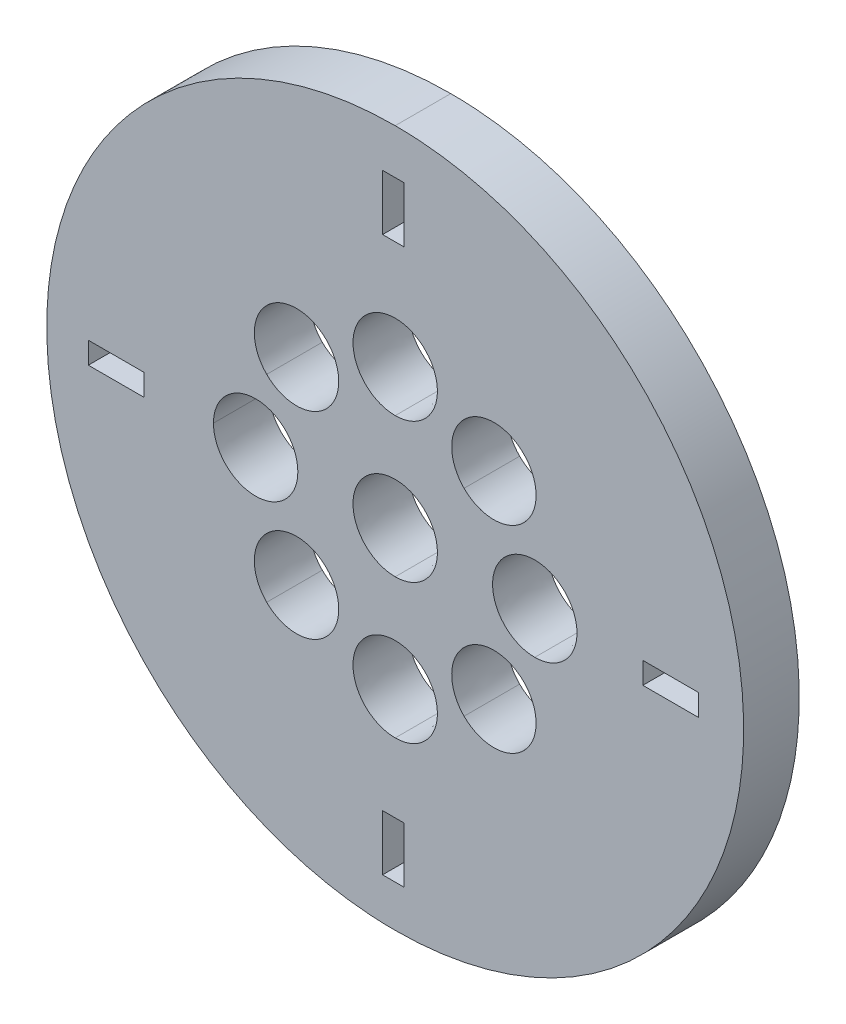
ISO-10303-21;
HEADER;
FILE_DESCRIPTION(('STEP AP214'),'2;1');
FILE_NAME('part.step','',(''),(''),'','','');
FILE_SCHEMA(('AUTOMOTIVE_DESIGN { 1 0 10303 214 1 1 1 1 }'));
ENDSEC;
DATA;
#1=APPLICATION_CONTEXT('core data for automotive mechanical design processes');
#2=APPLICATION_PROTOCOL_DEFINITION('international standard','automotive_design',2000,#1);
#3=PRODUCT_CONTEXT('',#1,'mechanical');
#4=PRODUCT('Part','Part','',(#3));
#5=PRODUCT_RELATED_PRODUCT_CATEGORY('part','',(#4));
#6=PRODUCT_DEFINITION_FORMATION('','',#4);
#7=PRODUCT_DEFINITION_CONTEXT('part definition',#1,'design');
#8=PRODUCT_DEFINITION('design','',#6,#7);
#9=PRODUCT_DEFINITION_SHAPE('','',#8);
#10=(LENGTH_UNIT() NAMED_UNIT(*) SI_UNIT(.MILLI.,.METRE.));
#11=(NAMED_UNIT(*) PLANE_ANGLE_UNIT() SI_UNIT($,.RADIAN.));
#12=(NAMED_UNIT(*) SI_UNIT($,.STERADIAN.) SOLID_ANGLE_UNIT());
#13=UNCERTAINTY_MEASURE_WITH_UNIT(LENGTH_MEASURE(1.E-05),#10,'distance_accuracy_value','');
#14=(GEOMETRIC_REPRESENTATION_CONTEXT(3) GLOBAL_UNCERTAINTY_ASSIGNED_CONTEXT((#13)) GLOBAL_UNIT_ASSIGNED_CONTEXT((#10,
#11,#12)) REPRESENTATION_CONTEXT('',''));
#15=CARTESIAN_POINT('',(0.,0.,0.));
#16=DIRECTION('',(0.,0.,1.));
#17=DIRECTION('',(1.,0.,0.));
#18=AXIS2_PLACEMENT_3D('',#15,#16,#17);
#19=CARTESIAN_POINT('',(272.335826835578,314.905763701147,3.));
#20=DIRECTION('',(0.,0.,-1.));
#21=DIRECTION('',(-1.,0.,0.));
#22=AXIS2_PLACEMENT_3D('',#19,#20,#21);
#23=PLANE('',#22);
#24=CARTESIAN_POINT('',(294.863214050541,318.623016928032,3.));
#25=CARTESIAN_POINT('',(295.752264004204,317.734010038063,3.));
#26=CARTESIAN_POINT('',(297.193691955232,317.734010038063,3.));
#27=CARTESIAN_POINT('',(298.082741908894,318.623016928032,3.));
#28=B_SPLINE_CURVE_WITH_KNOTS('',3,(#24,#25,#26,#27),.UNSPECIFIED.,.F.,.F.,(4,4),(2.,3.),.UNSPECIFIED.);
#29=CARTESIAN_POINT('',(294.863214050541,318.623016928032,3.));
#30=VERTEX_POINT('',#29);
#31=CARTESIAN_POINT('',(298.082741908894,318.623016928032,3.));
#32=VERTEX_POINT('',#31);
#33=EDGE_CURVE('E360',#30,#32,#28,.T.);
#34=ORIENTED_EDGE('',*,*,#33,.F.);
#35=CARTESIAN_POINT('',(294.863214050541,321.842630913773,3.));
#36=CARTESIAN_POINT('',(293.974164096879,320.953624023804,3.));
#37=CARTESIAN_POINT('',(293.974164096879,319.512196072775,3.));
#38=CARTESIAN_POINT('',(294.863214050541,318.623016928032,3.));
#39=B_SPLINE_CURVE_WITH_KNOTS('',3,(#35,#36,#37,#38),.UNSPECIFIED.,.F.,.F.,(4,4),(3.,4.),.UNSPECIFIED.);
#40=CARTESIAN_POINT('',(294.863214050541,321.842630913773,3.));
#41=VERTEX_POINT('',#40);
#42=EDGE_CURVE('E393',#41,#30,#39,.T.);
#43=ORIENTED_EDGE('',*,*,#42,.F.);
#44=CARTESIAN_POINT('',(298.082741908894,318.623016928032,3.));
#45=CARTESIAN_POINT('',(298.971791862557,319.512196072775,3.));
#46=CARTESIAN_POINT('',(298.971791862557,320.953624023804,3.));
#47=CARTESIAN_POINT('',(297.193691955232,322.731637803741,3.));
#48=CARTESIAN_POINT('',(295.752264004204,322.731637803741,3.));
#49=CARTESIAN_POINT('',(294.863214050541,321.842630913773,3.));
#50=B_SPLINE_CURVE_WITH_KNOTS('',3,(#44,#45,#46,#47,#48,#49),.UNSPECIFIED.,.F.,.F.,(4,2,4),(0.,
1.,2.),.UNSPECIFIED.);
#51=EDGE_CURVE('E366',#32,#41,#50,.T.);
#52=ORIENTED_EDGE('',*,*,#51,.F.);
#53=EDGE_LOOP('',(#34,#43,#52));
#54=FACE_BOUND('',#53,.T.);
#55=CARTESIAN_POINT('',(285.888654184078,314.905758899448,3.));
#56=CARTESIAN_POINT('',(285.888654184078,316.16304649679,3.));
#57=CARTESIAN_POINT('',(284.869422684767,317.182277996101,3.));
#58=CARTESIAN_POINT('',(283.612092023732,317.182277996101,3.));
#59=CARTESIAN_POINT('',(282.35480442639,317.182277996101,3.));
#60=CARTESIAN_POINT('',(281.335572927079,316.16304649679,3.));
#61=CARTESIAN_POINT('',(281.335572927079,314.905758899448,3.));
#62=B_SPLINE_CURVE_WITH_KNOTS('',3,(#55,#56,#57,#58,#59,#60,#61),.UNSPECIFIED.,.F.,.F.,(4,3,4),
(0.,1.,2.),.UNSPECIFIED.);
#63=CARTESIAN_POINT('',(285.888654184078,314.905758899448,3.));
#64=VERTEX_POINT('',#63);
#65=CARTESIAN_POINT('',(281.335572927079,314.905758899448,3.));
#66=VERTEX_POINT('',#65);
#67=EDGE_CURVE('E478',#64,#66,#62,.T.);
#68=ORIENTED_EDGE('',*,*,#67,.F.);
#69=CARTESIAN_POINT('',(281.335572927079,314.905758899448,3.));
#70=CARTESIAN_POINT('',(281.335572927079,313.648299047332,3.));
#71=CARTESIAN_POINT('',(282.35480442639,312.62906754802,3.));
#72=CARTESIAN_POINT('',(283.612092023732,312.62906754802,3.));
#73=CARTESIAN_POINT('',(284.869422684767,312.62906754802,3.));
#74=CARTESIAN_POINT('',(285.888654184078,313.648299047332,3.));
#75=CARTESIAN_POINT('',(285.888654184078,314.905758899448,3.));
#76=B_SPLINE_CURVE_WITH_KNOTS('',3,(#69,#70,#71,#72,#73,#74,#75),.UNSPECIFIED.,.F.,.F.,(4,3,4),
(2.,3.,4.),.UNSPECIFIED.);
#77=EDGE_CURVE('E482',#66,#64,#76,.T.);
#78=ORIENTED_EDGE('',*,*,#77,.F.);
#79=EDGE_LOOP('',(#68,#78));
#80=FACE_BOUND('',#79,.T.);
#81=CARTESIAN_POINT('',(287.428482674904,321.842630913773,3.));
#82=CARTESIAN_POINT('',(286.539389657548,322.731637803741,3.));
#83=CARTESIAN_POINT('',(285.09796170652,322.731637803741,3.));
#84=CARTESIAN_POINT('',(284.208954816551,321.842630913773,3.));
#85=B_SPLINE_CURVE_WITH_KNOTS('',3,(#81,#82,#83,#84),.UNSPECIFIED.,.F.,.F.,(4,4),(2.,3.),.UNSPECIFIED.);
#86=CARTESIAN_POINT('',(287.428482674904,321.842630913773,3.));
#87=VERTEX_POINT('',#86);
#88=CARTESIAN_POINT('',(284.208954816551,321.842630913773,3.));
#89=VERTEX_POINT('',#88);
#90=EDGE_CURVE('E784',#87,#89,#85,.T.);
#91=ORIENTED_EDGE('',*,*,#90,.F.);
#92=CARTESIAN_POINT('',(287.428482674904,318.623016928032,3.));
#93=CARTESIAN_POINT('',(288.317489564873,319.512196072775,3.));
#94=CARTESIAN_POINT('',(288.317489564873,320.953624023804,3.));
#95=CARTESIAN_POINT('',(287.428482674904,321.842630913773,3.));
#96=B_SPLINE_CURVE_WITH_KNOTS('',3,(#92,#93,#94,#95),.UNSPECIFIED.,.F.,.F.,(4,4),(3.,4.),.UNSPECIFIED.);
#97=CARTESIAN_POINT('',(287.428482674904,318.623016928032,3.));
#98=VERTEX_POINT('',#97);
#99=EDGE_CURVE('E779',#98,#87,#96,.T.);
#100=ORIENTED_EDGE('',*,*,#99,.F.);
#101=CARTESIAN_POINT('',(284.208954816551,318.623016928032,3.));
#102=CARTESIAN_POINT('',(285.09796170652,317.734010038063,3.));
#103=CARTESIAN_POINT('',(286.539389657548,317.734010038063,3.));
#104=CARTESIAN_POINT('',(287.428482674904,318.623016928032,3.));
#105=B_SPLINE_CURVE_WITH_KNOTS('',3,(#101,#102,#103,#104),.UNSPECIFIED.,.F.,.F.,(4,4),(0.,1.),.UNSPECIFIED.);
#106=CARTESIAN_POINT('',(284.208954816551,318.623016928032,3.));
#107=VERTEX_POINT('',#106);
#108=EDGE_CURVE('E817',#107,#98,#105,.T.);
#109=ORIENTED_EDGE('',*,*,#108,.F.);
#110=CARTESIAN_POINT('',(284.208954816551,321.842630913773,3.));
#111=CARTESIAN_POINT('',(283.319861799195,320.953624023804,3.));
#112=CARTESIAN_POINT('',(283.319861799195,319.512196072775,3.));
#113=CARTESIAN_POINT('',(284.208954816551,318.623016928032,3.));
#114=B_SPLINE_CURVE_WITH_KNOTS('',3,(#110,#111,#112,#113),.UNSPECIFIED.,.F.,.F.,(4,4),(1.,2.),.UNSPECIFIED.);
#115=EDGE_CURVE('E925',#89,#107,#114,.T.);
#116=ORIENTED_EDGE('',*,*,#115,.F.);
#117=EDGE_LOOP('',(#91,#100,#109,#116));
#118=FACE_BOUND('',#117,.T.);
#119=CARTESIAN_POINT('',(291.145826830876,309.648543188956,3.));
#120=CARTESIAN_POINT('',(289.888539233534,309.648543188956,3.));
#121=CARTESIAN_POINT('',(288.869307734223,308.629311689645,3.));
#122=CARTESIAN_POINT('',(288.869307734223,307.372024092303,3.));
#123=CARTESIAN_POINT('',(288.869307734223,306.114564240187,3.));
#124=CARTESIAN_POINT('',(289.888539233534,305.095332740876,3.));
#125=CARTESIAN_POINT('',(291.145826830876,305.095332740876,3.));
#126=B_SPLINE_CURVE_WITH_KNOTS('',3,(#119,#120,#121,#122,#123,#124,#125),.UNSPECIFIED.,.F.,.F.,
(4,3,4),(0.,1.,2.),.UNSPECIFIED.);
#127=CARTESIAN_POINT('',(291.145826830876,309.648543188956,3.));
#128=VERTEX_POINT('',#127);
#129=CARTESIAN_POINT('',(291.145826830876,305.095332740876,3.));
#130=VERTEX_POINT('',#129);
#131=EDGE_CURVE('E705',#128,#130,#126,.T.);
#132=ORIENTED_EDGE('',*,*,#131,.F.);
#133=CARTESIAN_POINT('',(291.145826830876,305.095332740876,3.));
#134=CARTESIAN_POINT('',(292.403114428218,305.095332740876,3.));
#135=CARTESIAN_POINT('',(293.422388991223,306.114564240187,3.));
#136=CARTESIAN_POINT('',(293.422388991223,307.372024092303,3.));
#137=CARTESIAN_POINT('',(293.422388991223,308.629311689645,3.));
#138=CARTESIAN_POINT('',(292.403114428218,309.648543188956,3.));
#139=CARTESIAN_POINT('',(291.145826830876,309.648543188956,3.));
#140=B_SPLINE_CURVE_WITH_KNOTS('',3,(#133,#134,#135,#136,#137,#138,#139),.UNSPECIFIED.,.F.,.F.,
(4,3,4),(2.,3.,4.),.UNSPECIFIED.);
#141=EDGE_CURVE('E708',#130,#128,#140,.T.);
#142=ORIENTED_EDGE('',*,*,#141,.F.);
#143=EDGE_LOOP('',(#132,#142));
#144=FACE_BOUND('',#143,.T.);
#145=CARTESIAN_POINT('',(291.145826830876,324.716012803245,3.));
#146=CARTESIAN_POINT('',(289.888539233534,324.716012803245,3.));
#147=CARTESIAN_POINT('',(288.869307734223,323.69660904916,3.));
#148=CARTESIAN_POINT('',(288.869307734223,322.439493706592,3.));
#149=CARTESIAN_POINT('',(288.869307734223,321.182033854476,3.));
#150=CARTESIAN_POINT('',(289.888539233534,320.162802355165,3.));
#151=CARTESIAN_POINT('',(291.145826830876,320.162802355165,3.));
#152=B_SPLINE_CURVE_WITH_KNOTS('',3,(#145,#146,#147,#148,#149,#150,#151),.UNSPECIFIED.,.F.,.F.,
(4,3,4),(0.,1.,2.),.UNSPECIFIED.);
#153=CARTESIAN_POINT('',(291.145826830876,324.716012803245,3.));
#154=VERTEX_POINT('',#153);
#155=CARTESIAN_POINT('',(291.145826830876,320.162802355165,3.));
#156=VERTEX_POINT('',#155);
#157=EDGE_CURVE('E629',#154,#156,#152,.T.);
#158=ORIENTED_EDGE('',*,*,#157,.F.);
#159=CARTESIAN_POINT('',(291.145826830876,320.162802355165,3.));
#160=CARTESIAN_POINT('',(292.403114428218,320.162802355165,3.));
#161=CARTESIAN_POINT('',(293.422388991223,321.182033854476,3.));
#162=CARTESIAN_POINT('',(293.422388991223,322.439493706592,3.));
#163=CARTESIAN_POINT('',(293.422388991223,323.69660904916,3.));
#164=CARTESIAN_POINT('',(292.403114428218,324.716012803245,3.));
#165=CARTESIAN_POINT('',(291.145826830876,324.716012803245,3.));
#166=B_SPLINE_CURVE_WITH_KNOTS('',3,(#159,#160,#161,#162,#163,#164,#165),.UNSPECIFIED.,.F.,.F.,
(4,3,4),(2.,3.,4.),.UNSPECIFIED.);
#167=EDGE_CURVE('E637',#156,#154,#166,.T.);
#168=ORIENTED_EDGE('',*,*,#167,.F.);
#169=EDGE_LOOP('',(#158,#168));
#170=FACE_BOUND('',#169,.T.);
#171=CARTESIAN_POINT('',(298.67956163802,317.182277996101,3.));
#172=CARTESIAN_POINT('',(297.422274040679,317.182277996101,3.));
#173=CARTESIAN_POINT('',(296.402999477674,316.16304649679,3.));
#174=CARTESIAN_POINT('',(296.402999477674,314.905758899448,3.));
#175=CARTESIAN_POINT('',(296.402999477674,313.648299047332,3.));
#176=CARTESIAN_POINT('',(297.422274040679,312.62906754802,3.));
#177=CARTESIAN_POINT('',(298.67956163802,312.62906754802,3.));
#178=B_SPLINE_CURVE_WITH_KNOTS('',3,(#171,#172,#173,#174,#175,#176,#177),.UNSPECIFIED.,.F.,.F.,
(4,3,4),(0.,1.,2.),.UNSPECIFIED.);
#179=CARTESIAN_POINT('',(298.67956163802,317.182277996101,3.));
#180=VERTEX_POINT('',#179);
#181=CARTESIAN_POINT('',(298.67956163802,312.62906754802,3.));
#182=VERTEX_POINT('',#181);
#183=EDGE_CURVE('E556',#180,#182,#178,.T.);
#184=ORIENTED_EDGE('',*,*,#183,.F.);
#185=CARTESIAN_POINT('',(298.67956163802,312.62906754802,3.));
#186=CARTESIAN_POINT('',(299.936849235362,312.62906754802,3.));
#187=CARTESIAN_POINT('',(300.956080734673,313.648299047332,3.));
#188=CARTESIAN_POINT('',(300.956080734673,314.905758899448,3.));
#189=CARTESIAN_POINT('',(300.956080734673,316.16304649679,3.));
#190=CARTESIAN_POINT('',(299.936849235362,317.182277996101,3.));
#191=CARTESIAN_POINT('',(298.67956163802,317.182277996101,3.));
#192=B_SPLINE_CURVE_WITH_KNOTS('',3,(#185,#186,#187,#188,#189,#190,#191),.UNSPECIFIED.,.F.,.F.,
(4,3,4),(2.,3.,4.),.UNSPECIFIED.);
#193=EDGE_CURVE('E566',#182,#180,#192,.T.);
#194=ORIENTED_EDGE('',*,*,#193,.F.);
#195=EDGE_LOOP('',(#184,#194));
#196=FACE_BOUND('',#195,.T.);
#197=CARTESIAN_POINT('',(291.145826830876,333.715718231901,3.));
#198=CARTESIAN_POINT('',(280.757360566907,333.715718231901,3.));
#199=CARTESIAN_POINT('',(272.335826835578,325.294229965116,3.));
#200=CARTESIAN_POINT('',(272.335826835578,304.517297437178,3.));
#201=CARTESIAN_POINT('',(280.757360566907,296.09562731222,3.));
#202=CARTESIAN_POINT('',(291.145826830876,296.09562731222,3.));
#203=B_SPLINE_CURVE_WITH_KNOTS('',3,(#197,#198,#199,#200,#201,#202),.UNSPECIFIED.,.F.,.F.,(4,2,
4),(0.,1.,2.),.UNSPECIFIED.);
#204=CARTESIAN_POINT('',(291.145826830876,333.715718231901,3.));
#205=VERTEX_POINT('',#204);
#206=CARTESIAN_POINT('',(291.145826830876,296.09562731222,3.));
#207=VERTEX_POINT('',#206);
#208=EDGE_CURVE('E1018',#205,#207,#203,.T.);
#209=ORIENTED_EDGE('',*,*,#208,.T.);
#210=CARTESIAN_POINT('',(291.145826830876,296.09562731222,3.));
#211=CARTESIAN_POINT('',(301.534293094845,296.09562731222,3.));
#212=CARTESIAN_POINT('',(309.955826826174,304.517297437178,3.));
#213=CARTESIAN_POINT('',(309.955826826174,325.294229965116,3.));
#214=CARTESIAN_POINT('',(301.534293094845,333.715718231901,3.));
#215=CARTESIAN_POINT('',(291.145826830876,333.715718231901,3.));
#216=B_SPLINE_CURVE_WITH_KNOTS('',3,(#210,#211,#212,#213,#214,#215),.UNSPECIFIED.,.F.,.F.,(4,2,
4),(2.,3.,4.),.UNSPECIFIED.);
#217=EDGE_CURVE('E1025',#207,#205,#216,.T.);
#218=ORIENTED_EDGE('',*,*,#217,.T.);
#219=EDGE_LOOP('',(#209,#218));
#220=FACE_BOUND('',#219,.T.);
#221=DIRECTION('',(1.,0.,0.));
#222=VECTOR('',#221,1.);
#223=CARTESIAN_POINT('',(307.513733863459,314.236549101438,3.));
#224=LINE('',#223,#222);
#225=CARTESIAN_POINT('',(304.511677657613,314.236549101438,3.));
#226=VERTEX_POINT('',#225);
#227=CARTESIAN_POINT('',(307.513733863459,314.236549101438,3.));
#228=VERTEX_POINT('',#227);
#229=EDGE_CURVE('E982',#226,#228,#224,.T.);
#230=ORIENTED_EDGE('',*,*,#229,.F.);
#231=DIRECTION('',(0.,-1.,0.));
#232=VECTOR('',#231,1.);
#233=CARTESIAN_POINT('',(304.511677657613,314.236549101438,3.));
#234=LINE('',#233,#232);
#235=CARTESIAN_POINT('',(304.511677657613,315.404264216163,3.));
#236=VERTEX_POINT('',#235);
#237=EDGE_CURVE('E993',#236,#226,#234,.T.);
#238=ORIENTED_EDGE('',*,*,#237,.F.);
#239=DIRECTION('',(-1.,0.,0.));
#240=VECTOR('',#239,1.);
#241=CARTESIAN_POINT('',(304.511677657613,315.404264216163,3.));
#242=LINE('',#241,#240);
#243=CARTESIAN_POINT('',(307.513733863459,315.404264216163,3.));
#244=VERTEX_POINT('',#243);
#245=EDGE_CURVE('E988',#244,#236,#242,.T.);
#246=ORIENTED_EDGE('',*,*,#245,.F.);
#247=DIRECTION('',(0.,1.,0.));
#248=VECTOR('',#247,1.);
#249=CARTESIAN_POINT('',(307.513733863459,315.404264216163,3.));
#250=LINE('',#249,#248);
#251=EDGE_CURVE('E990',#228,#244,#250,.T.);
#252=ORIENTED_EDGE('',*,*,#251,.F.);
#253=EDGE_LOOP('',(#230,#238,#246,#252));
#254=FACE_BOUND('',#253,.T.);
#255=CARTESIAN_POINT('',(294.863214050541,307.968714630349,3.));
#256=CARTESIAN_POINT('',(295.752264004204,307.07970774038,3.));
#257=CARTESIAN_POINT('',(297.193691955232,307.07970774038,3.));
#258=CARTESIAN_POINT('',(298.082741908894,307.968714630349,3.));
#259=B_SPLINE_CURVE_WITH_KNOTS('',3,(#255,#256,#257,#258),.UNSPECIFIED.,.F.,.F.,(4,4),(0.,1.),.UNSPECIFIED.);
#260=CARTESIAN_POINT('',(294.863214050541,307.968714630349,3.));
#261=VERTEX_POINT('',#260);
#262=CARTESIAN_POINT('',(298.082741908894,307.968714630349,3.));
#263=VERTEX_POINT('',#262);
#264=EDGE_CURVE('E591',#261,#263,#259,.T.);
#265=ORIENTED_EDGE('',*,*,#264,.F.);
#266=CARTESIAN_POINT('',(298.082741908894,307.968714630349,3.));
#267=CARTESIAN_POINT('',(298.971791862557,308.857893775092,3.));
#268=CARTESIAN_POINT('',(298.971791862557,310.29932172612,3.));
#269=CARTESIAN_POINT('',(297.193691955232,312.077335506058,3.));
#270=CARTESIAN_POINT('',(295.752264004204,312.077335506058,3.));
#271=CARTESIAN_POINT('',(293.974164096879,310.29932172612,3.));
#272=CARTESIAN_POINT('',(293.974164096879,308.857893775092,3.));
#273=CARTESIAN_POINT('',(294.863214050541,307.968714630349,3.));
#274=B_SPLINE_CURVE_WITH_KNOTS('',3,(#266,#267,#268,#269,#270,#271,#272,#273),.UNSPECIFIED.,.F.,
.F.,(4,2,2,4),(1.,2.,3.,4.),.UNSPECIFIED.);
#275=EDGE_CURVE('E585',#263,#261,#274,.T.);
#276=ORIENTED_EDGE('',*,*,#275,.F.);
#277=EDGE_LOOP('',(#265,#276));
#278=FACE_BOUND('',#277,.T.);
#279=CARTESIAN_POINT('',(291.145826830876,317.182277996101,3.));
#280=CARTESIAN_POINT('',(289.888539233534,317.182277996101,3.));
#281=CARTESIAN_POINT('',(288.869307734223,316.16304649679,3.));
#282=CARTESIAN_POINT('',(288.869307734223,314.905758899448,3.));
#283=CARTESIAN_POINT('',(288.869307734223,313.648299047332,3.));
#284=CARTESIAN_POINT('',(289.888539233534,312.62906754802,3.));
#285=CARTESIAN_POINT('',(291.145826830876,312.62906754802,3.));
#286=B_SPLINE_CURVE_WITH_KNOTS('',3,(#279,#280,#281,#282,#283,#284,#285),.UNSPECIFIED.,.F.,.F.,
(4,3,4),(0.,1.,2.),.UNSPECIFIED.);
#287=CARTESIAN_POINT('',(291.145826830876,317.182277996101,3.));
#288=VERTEX_POINT('',#287);
#289=CARTESIAN_POINT('',(291.145826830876,312.62906754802,3.));
#290=VERTEX_POINT('',#289);
#291=EDGE_CURVE('E661',#288,#290,#286,.T.);
#292=ORIENTED_EDGE('',*,*,#291,.F.);
#293=CARTESIAN_POINT('',(291.145826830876,312.62906754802,3.));
#294=CARTESIAN_POINT('',(292.403114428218,312.62906754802,3.));
#295=CARTESIAN_POINT('',(293.422388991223,313.648299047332,3.));
#296=CARTESIAN_POINT('',(293.422388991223,314.905758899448,3.));
#297=CARTESIAN_POINT('',(293.422388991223,316.16304649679,3.));
#298=CARTESIAN_POINT('',(292.403114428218,317.182277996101,3.));
#299=CARTESIAN_POINT('',(291.145826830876,317.182277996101,3.));
#300=B_SPLINE_CURVE_WITH_KNOTS('',3,(#293,#294,#295,#296,#297,#298,#299),.UNSPECIFIED.,.F.,.F.,
(4,3,4),(2.,3.,4.),.UNSPECIFIED.);
#301=EDGE_CURVE('E652',#290,#288,#300,.T.);
#302=ORIENTED_EDGE('',*,*,#301,.F.);
#303=EDGE_LOOP('',(#292,#302));
#304=FACE_BOUND('',#303,.T.);
#305=DIRECTION('',(0.,1.,0.));
#306=VECTOR('',#305,1.);
#307=CARTESIAN_POINT('',(291.630810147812,301.355681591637,3.));
#308=LINE('',#307,#306);
#309=CARTESIAN_POINT('',(291.630810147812,298.353625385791,3.));
#310=VERTEX_POINT('',#309);
#311=CARTESIAN_POINT('',(291.630810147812,301.355681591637,3.));
#312=VERTEX_POINT('',#311);
#313=EDGE_CURVE('E739',#310,#312,#308,.T.);
#314=ORIENTED_EDGE('',*,*,#313,.F.);
#315=DIRECTION('',(1.,0.,0.));
#316=VECTOR('',#315,1.);
#317=CARTESIAN_POINT('',(291.630810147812,298.353625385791,3.));
#318=LINE('',#317,#316);
#319=CARTESIAN_POINT('',(290.463095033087,298.353625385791,3.));
#320=VERTEX_POINT('',#319);
#321=EDGE_CURVE('E735',#320,#310,#318,.T.);
#322=ORIENTED_EDGE('',*,*,#321,.F.);
#323=DIRECTION('',(0.,-1.,0.));
#324=VECTOR('',#323,1.);
#325=CARTESIAN_POINT('',(290.463095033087,298.353625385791,3.));
#326=LINE('',#325,#324);
#327=CARTESIAN_POINT('',(290.463095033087,301.355681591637,3.));
#328=VERTEX_POINT('',#327);
#329=EDGE_CURVE('E754',#328,#320,#326,.T.);
#330=ORIENTED_EDGE('',*,*,#329,.F.);
#331=DIRECTION('',(-1.,0.,0.));
#332=VECTOR('',#331,1.);
#333=CARTESIAN_POINT('',(290.463095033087,301.355681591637,3.));
#334=LINE('',#333,#332);
#335=EDGE_CURVE('E758',#312,#328,#334,.T.);
#336=ORIENTED_EDGE('',*,*,#335,.F.);
#337=EDGE_LOOP('',(#314,#322,#330,#336));
#338=FACE_BOUND('',#337,.T.);
#339=CARTESIAN_POINT('',(287.428482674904,311.188328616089,3.));
#340=CARTESIAN_POINT('',(286.539389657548,312.077335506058,3.));
#341=CARTESIAN_POINT('',(285.09796170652,312.077335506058,3.));
#342=CARTESIAN_POINT('',(284.208954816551,311.188328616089,3.));
#343=B_SPLINE_CURVE_WITH_KNOTS('',3,(#339,#340,#341,#342),.UNSPECIFIED.,.F.,.F.,(4,4),(2.,3.),.UNSPECIFIED.);
#344=CARTESIAN_POINT('',(287.428482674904,311.188328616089,3.));
#345=VERTEX_POINT('',#344);
#346=CARTESIAN_POINT('',(284.208954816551,311.188328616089,3.));
#347=VERTEX_POINT('',#346);
#348=EDGE_CURVE('E845',#345,#347,#343,.T.);
#349=ORIENTED_EDGE('',*,*,#348,.F.);
#350=CARTESIAN_POINT('',(287.428482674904,307.968714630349,3.));
#351=CARTESIAN_POINT('',(288.317489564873,308.857893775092,3.));
#352=CARTESIAN_POINT('',(288.317489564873,310.29932172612,3.));
#353=CARTESIAN_POINT('',(287.428482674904,311.188328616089,3.));
#354=B_SPLINE_CURVE_WITH_KNOTS('',3,(#350,#351,#352,#353),.UNSPECIFIED.,.F.,.F.,(4,4),(3.,4.),.UNSPECIFIED.);
#355=CARTESIAN_POINT('',(287.428482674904,307.968714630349,3.));
#356=VERTEX_POINT('',#355);
#357=EDGE_CURVE('E909',#356,#345,#354,.T.);
#358=ORIENTED_EDGE('',*,*,#357,.F.);
#359=CARTESIAN_POINT('',(284.208954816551,307.968714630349,3.));
#360=CARTESIAN_POINT('',(285.09796170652,307.07970774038,3.));
#361=CARTESIAN_POINT('',(286.539389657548,307.07970774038,3.));
#362=CARTESIAN_POINT('',(287.428482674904,307.968714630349,3.));
#363=B_SPLINE_CURVE_WITH_KNOTS('',3,(#359,#360,#361,#362),.UNSPECIFIED.,.F.,.F.,(4,4),(0.,1.),.UNSPECIFIED.);
#364=CARTESIAN_POINT('',(284.208954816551,307.968714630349,3.));
#365=VERTEX_POINT('',#364);
#366=EDGE_CURVE('E904',#365,#356,#363,.T.);
#367=ORIENTED_EDGE('',*,*,#366,.F.);
#368=CARTESIAN_POINT('',(284.208954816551,311.188328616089,3.));
#369=CARTESIAN_POINT('',(283.319861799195,310.29932172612,3.));
#370=CARTESIAN_POINT('',(283.319861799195,308.857893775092,3.));
#371=CARTESIAN_POINT('',(284.208954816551,307.968714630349,3.));
#372=B_SPLINE_CURVE_WITH_KNOTS('',3,(#368,#369,#370,#371),.UNSPECIFIED.,.F.,.F.,(4,4),(1.,2.),.UNSPECIFIED.);
#373=EDGE_CURVE('E847',#347,#365,#372,.T.);
#374=ORIENTED_EDGE('',*,*,#373,.F.);
#375=EDGE_LOOP('',(#349,#358,#367,#374));
#376=FACE_BOUND('',#375,.T.);
#377=DIRECTION('',(0.,-1.,0.));
#378=VECTOR('',#377,1.);
#379=CARTESIAN_POINT('',(290.463095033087,328.285131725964,3.));
#380=LINE('',#379,#378);
#381=CARTESIAN_POINT('',(290.463095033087,331.28718793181,3.));
#382=VERTEX_POINT('',#381);
#383=CARTESIAN_POINT('',(290.463095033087,328.285131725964,3.));
#384=VERTEX_POINT('',#383);
#385=EDGE_CURVE('E433',#382,#384,#380,.T.);
#386=ORIENTED_EDGE('',*,*,#385,.F.);
#387=DIRECTION('',(-1.,0.,0.));
#388=VECTOR('',#387,1.);
#389=CARTESIAN_POINT('',(290.463095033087,331.28718793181,3.));
#390=LINE('',#389,#388);
#391=CARTESIAN_POINT('',(291.630810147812,331.28718793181,3.));
#392=VERTEX_POINT('',#391);
#393=EDGE_CURVE('E443',#392,#382,#390,.T.);
#394=ORIENTED_EDGE('',*,*,#393,.F.);
#395=DIRECTION('',(0.,1.,0.));
#396=VECTOR('',#395,1.);
#397=CARTESIAN_POINT('',(291.630810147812,331.28718793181,3.));
#398=LINE('',#397,#396);
#399=CARTESIAN_POINT('',(291.630810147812,328.285131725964,3.));
#400=VERTEX_POINT('',#399);
#401=EDGE_CURVE('E439',#400,#392,#398,.T.);
#402=ORIENTED_EDGE('',*,*,#401,.F.);
#403=DIRECTION('',(1.,0.,0.));
#404=VECTOR('',#403,1.);
#405=CARTESIAN_POINT('',(291.630810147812,328.285131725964,3.));
#406=LINE('',#405,#404);
#407=EDGE_CURVE('E440',#384,#400,#406,.T.);
#408=ORIENTED_EDGE('',*,*,#407,.F.);
#409=EDGE_LOOP('',(#386,#394,#402,#408));
#410=FACE_BOUND('',#409,.T.);
#411=DIRECTION('',(0.,1.,0.));
#412=VECTOR('',#411,1.);
#413=CARTESIAN_POINT('',(277.582227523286,315.404264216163,3.));
#414=LINE('',#413,#412);
#415=CARTESIAN_POINT('',(277.582227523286,314.236549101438,3.));
#416=VERTEX_POINT('',#415);
#417=CARTESIAN_POINT('',(277.582227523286,315.404264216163,3.));
#418=VERTEX_POINT('',#417);
#419=EDGE_CURVE('E47',#416,#418,#414,.T.);
#420=ORIENTED_EDGE('',*,*,#419,.F.);
#421=DIRECTION('',(1.,0.,0.));
#422=VECTOR('',#421,1.);
#423=CARTESIAN_POINT('',(277.582227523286,314.236549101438,3.));
#424=LINE('',#423,#422);
#425=CARTESIAN_POINT('',(274.580171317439,314.236549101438,3.));
#426=VERTEX_POINT('',#425);
#427=EDGE_CURVE('E319',#426,#416,#424,.T.);
#428=ORIENTED_EDGE('',*,*,#427,.F.);
#429=DIRECTION('',(0.,-1.,0.));
#430=VECTOR('',#429,1.);
#431=CARTESIAN_POINT('',(274.580171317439,314.236549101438,3.));
#432=LINE('',#431,#430);
#433=CARTESIAN_POINT('',(274.580171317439,315.404264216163,3.));
#434=VERTEX_POINT('',#433);
#435=EDGE_CURVE('E330',#434,#426,#432,.T.);
#436=ORIENTED_EDGE('',*,*,#435,.F.);
#437=DIRECTION('',(-1.,0.,0.));
#438=VECTOR('',#437,1.);
#439=CARTESIAN_POINT('',(274.580171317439,315.404264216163,3.));
#440=LINE('',#439,#438);
#441=EDGE_CURVE('E77',#418,#434,#440,.T.);
#442=ORIENTED_EDGE('',*,*,#441,.F.);
#443=EDGE_LOOP('',(#420,#428,#436,#442));
#444=FACE_BOUND('',#443,.T.);
#445=ADVANCED_FACE('F44',(#54,#80,#118,#144,#170,#196,#220,#254,#278,#304,#338,#376,#410,#444),
#23,.F.);
#446=CARTESIAN_POINT('',(272.335826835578,314.905763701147,0.));
#447=DIRECTION('',(0.,0.,-1.));
#448=DIRECTION('',(-1.,0.,0.));
#449=AXIS2_PLACEMENT_3D('',#446,#447,#448);
#450=PLANE('',#449);
#451=CARTESIAN_POINT('',(291.145826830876,333.715718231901,0.));
#452=CARTESIAN_POINT('',(280.757360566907,333.715718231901,0.));
#453=CARTESIAN_POINT('',(272.335826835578,325.294229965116,0.));
#454=CARTESIAN_POINT('',(272.335826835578,304.517297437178,0.));
#455=CARTESIAN_POINT('',(280.757360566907,296.09562731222,0.));
#456=CARTESIAN_POINT('',(291.145826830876,296.09562731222,0.));
#457=B_SPLINE_CURVE_WITH_KNOTS('',3,(#451,#452,#453,#454,#455,#456),.UNSPECIFIED.,.F.,.F.,(4,2,
4),(0.,1.,2.),.UNSPECIFIED.);
#458=CARTESIAN_POINT('',(291.145826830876,333.715718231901,0.));
#459=VERTEX_POINT('',#458);
#460=CARTESIAN_POINT('',(291.145826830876,296.09562731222,0.));
#461=VERTEX_POINT('',#460);
#462=EDGE_CURVE('E1013',#459,#461,#457,.T.);
#463=ORIENTED_EDGE('',*,*,#462,.F.);
#464=CARTESIAN_POINT('',(291.145826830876,296.09562731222,0.));
#465=CARTESIAN_POINT('',(301.534293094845,296.09562731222,0.));
#466=CARTESIAN_POINT('',(309.955826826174,304.517297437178,0.));
#467=CARTESIAN_POINT('',(309.955826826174,325.294229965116,0.));
#468=CARTESIAN_POINT('',(301.534293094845,333.715718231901,0.));
#469=CARTESIAN_POINT('',(291.145826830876,333.715718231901,0.));
#470=B_SPLINE_CURVE_WITH_KNOTS('',3,(#464,#465,#466,#467,#468,#469),.UNSPECIFIED.,.F.,.F.,(4,2,
4),(2.,3.,4.),.UNSPECIFIED.);
#471=EDGE_CURVE('E1012',#461,#459,#470,.T.);
#472=ORIENTED_EDGE('',*,*,#471,.F.);
#473=EDGE_LOOP('',(#463,#472));
#474=FACE_BOUND('',#473,.T.);
#475=DIRECTION('',(0.,-1.,0.));
#476=VECTOR('',#475,1.);
#477=CARTESIAN_POINT('',(304.511677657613,314.236549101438,0.));
#478=LINE('',#477,#476);
#479=CARTESIAN_POINT('',(304.511677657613,315.404264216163,0.));
#480=VERTEX_POINT('',#479);
#481=CARTESIAN_POINT('',(304.511677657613,314.236549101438,0.));
#482=VERTEX_POINT('',#481);
#483=EDGE_CURVE('E977',#480,#482,#478,.T.);
#484=ORIENTED_EDGE('',*,*,#483,.T.);
#485=DIRECTION('',(1.,0.,0.));
#486=VECTOR('',#485,1.);
#487=CARTESIAN_POINT('',(307.513733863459,314.236549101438,0.));
#488=LINE('',#487,#486);
#489=CARTESIAN_POINT('',(307.513733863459,314.236549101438,0.));
#490=VERTEX_POINT('',#489);
#491=EDGE_CURVE('E969',#482,#490,#488,.T.);
#492=ORIENTED_EDGE('',*,*,#491,.T.);
#493=DIRECTION('',(0.,1.,0.));
#494=VECTOR('',#493,1.);
#495=CARTESIAN_POINT('',(307.513733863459,315.404264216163,0.));
#496=LINE('',#495,#494);
#497=CARTESIAN_POINT('',(307.513733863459,315.404264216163,0.));
#498=VERTEX_POINT('',#497);
#499=EDGE_CURVE('E971',#490,#498,#496,.T.);
#500=ORIENTED_EDGE('',*,*,#499,.T.);
#501=DIRECTION('',(-1.,0.,0.));
#502=VECTOR('',#501,1.);
#503=CARTESIAN_POINT('',(304.511677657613,315.404264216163,0.));
#504=LINE('',#503,#502);
#505=EDGE_CURVE('E978',#498,#480,#504,.T.);
#506=ORIENTED_EDGE('',*,*,#505,.T.);
#507=EDGE_LOOP('',(#484,#492,#500,#506));
#508=FACE_BOUND('',#507,.T.);
#509=CARTESIAN_POINT('',(298.67956163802,312.62906754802,0.));
#510=CARTESIAN_POINT('',(299.936849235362,312.62906754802,0.));
#511=CARTESIAN_POINT('',(300.956080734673,313.648299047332,0.));
#512=CARTESIAN_POINT('',(300.956080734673,314.905758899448,0.));
#513=CARTESIAN_POINT('',(300.956080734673,316.16304649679,0.));
#514=CARTESIAN_POINT('',(299.936849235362,317.182277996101,0.));
#515=CARTESIAN_POINT('',(298.67956163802,317.182277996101,0.));
#516=B_SPLINE_CURVE_WITH_KNOTS('',3,(#509,#510,#511,#512,#513,#514,#515),.UNSPECIFIED.,.F.,.F.,
(4,3,4),(2.,3.,4.),.UNSPECIFIED.);
#517=CARTESIAN_POINT('',(298.67956163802,312.62906754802,0.));
#518=VERTEX_POINT('',#517);
#519=CARTESIAN_POINT('',(298.67956163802,317.182277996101,0.));
#520=VERTEX_POINT('',#519);
#521=EDGE_CURVE('E564',#518,#520,#516,.T.);
#522=ORIENTED_EDGE('',*,*,#521,.T.);
#523=CARTESIAN_POINT('',(298.67956163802,317.182277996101,0.));
#524=CARTESIAN_POINT('',(297.422274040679,317.182277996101,0.));
#525=CARTESIAN_POINT('',(296.402999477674,316.16304649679,0.));
#526=CARTESIAN_POINT('',(296.402999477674,314.905758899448,0.));
#527=CARTESIAN_POINT('',(296.402999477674,313.648299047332,0.));
#528=CARTESIAN_POINT('',(297.422274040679,312.62906754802,0.));
#529=CARTESIAN_POINT('',(298.67956163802,312.62906754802,0.));
#530=B_SPLINE_CURVE_WITH_KNOTS('',3,(#523,#524,#525,#526,#527,#528,#529),.UNSPECIFIED.,.F.,.F.,
(4,3,4),(0.,1.,2.),.UNSPECIFIED.);
#531=EDGE_CURVE('E576',#520,#518,#530,.T.);
#532=ORIENTED_EDGE('',*,*,#531,.T.);
#533=EDGE_LOOP('',(#522,#532));
#534=FACE_BOUND('',#533,.T.);
#535=CARTESIAN_POINT('',(298.082741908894,307.968714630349,0.));
#536=CARTESIAN_POINT('',(298.971791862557,308.857893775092,0.));
#537=CARTESIAN_POINT('',(298.971791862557,310.29932172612,0.));
#538=CARTESIAN_POINT('',(297.193691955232,312.077335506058,0.));
#539=CARTESIAN_POINT('',(295.752264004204,312.077335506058,0.));
#540=CARTESIAN_POINT('',(293.974164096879,310.29932172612,0.));
#541=CARTESIAN_POINT('',(293.974164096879,308.857893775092,0.));
#542=CARTESIAN_POINT('',(294.863214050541,307.968714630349,0.));
#543=B_SPLINE_CURVE_WITH_KNOTS('',3,(#535,#536,#537,#538,#539,#540,#541,#542),.UNSPECIFIED.,.F.,
.F.,(4,2,2,4),(1.,2.,3.,4.),.UNSPECIFIED.);
#544=CARTESIAN_POINT('',(298.082741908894,307.968714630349,0.));
#545=VERTEX_POINT('',#544);
#546=CARTESIAN_POINT('',(294.863214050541,307.968714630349,0.));
#547=VERTEX_POINT('',#546);
#548=EDGE_CURVE('E583',#545,#547,#543,.T.);
#549=ORIENTED_EDGE('',*,*,#548,.T.);
#550=CARTESIAN_POINT('',(294.863214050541,307.968714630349,0.));
#551=CARTESIAN_POINT('',(295.752264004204,307.07970774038,0.));
#552=CARTESIAN_POINT('',(297.193691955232,307.07970774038,0.));
#553=CARTESIAN_POINT('',(298.082741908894,307.968714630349,0.));
#554=B_SPLINE_CURVE_WITH_KNOTS('',3,(#550,#551,#552,#553),.UNSPECIFIED.,.F.,.F.,(4,4),(0.,1.),.UNSPECIFIED.);
#555=EDGE_CURVE('E587',#547,#545,#554,.T.);
#556=ORIENTED_EDGE('',*,*,#555,.T.);
#557=EDGE_LOOP('',(#549,#556));
#558=FACE_BOUND('',#557,.T.);
#559=CARTESIAN_POINT('',(291.145826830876,320.162802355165,0.));
#560=CARTESIAN_POINT('',(292.403114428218,320.162802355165,0.));
#561=CARTESIAN_POINT('',(293.422388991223,321.182033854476,0.));
#562=CARTESIAN_POINT('',(293.422388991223,322.439493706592,0.));
#563=CARTESIAN_POINT('',(293.422388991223,323.69660904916,0.));
#564=CARTESIAN_POINT('',(292.403114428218,324.716012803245,0.));
#565=CARTESIAN_POINT('',(291.145826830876,324.716012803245,0.));
#566=B_SPLINE_CURVE_WITH_KNOTS('',3,(#559,#560,#561,#562,#563,#564,#565),.UNSPECIFIED.,.F.,.F.,
(4,3,4),(2.,3.,4.),.UNSPECIFIED.);
#567=CARTESIAN_POINT('',(291.145826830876,320.162802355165,0.));
#568=VERTEX_POINT('',#567);
#569=CARTESIAN_POINT('',(291.145826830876,324.716012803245,0.));
#570=VERTEX_POINT('',#569);
#571=EDGE_CURVE('E640',#568,#570,#566,.T.);
#572=ORIENTED_EDGE('',*,*,#571,.T.);
#573=CARTESIAN_POINT('',(291.145826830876,324.716012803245,0.));
#574=CARTESIAN_POINT('',(289.888539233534,324.716012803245,0.));
#575=CARTESIAN_POINT('',(288.869307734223,323.69660904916,0.));
#576=CARTESIAN_POINT('',(288.869307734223,322.439493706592,0.));
#577=CARTESIAN_POINT('',(288.869307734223,321.182033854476,0.));
#578=CARTESIAN_POINT('',(289.888539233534,320.162802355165,0.));
#579=CARTESIAN_POINT('',(291.145826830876,320.162802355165,0.));
#580=B_SPLINE_CURVE_WITH_KNOTS('',3,(#573,#574,#575,#576,#577,#578,#579),.UNSPECIFIED.,.F.,.F.,
(4,3,4),(0.,1.,2.),.UNSPECIFIED.);
#581=EDGE_CURVE('E653',#570,#568,#580,.T.);
#582=ORIENTED_EDGE('',*,*,#581,.T.);
#583=EDGE_LOOP('',(#572,#582));
#584=FACE_BOUND('',#583,.T.);
#585=CARTESIAN_POINT('',(291.145826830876,312.62906754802,0.));
#586=CARTESIAN_POINT('',(292.403114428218,312.62906754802,0.));
#587=CARTESIAN_POINT('',(293.422388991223,313.648299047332,0.));
#588=CARTESIAN_POINT('',(293.422388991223,314.905758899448,0.));
#589=CARTESIAN_POINT('',(293.422388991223,316.16304649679,0.));
#590=CARTESIAN_POINT('',(292.403114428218,317.182277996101,0.));
#591=CARTESIAN_POINT('',(291.145826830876,317.182277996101,0.));
#592=B_SPLINE_CURVE_WITH_KNOTS('',3,(#585,#586,#587,#588,#589,#590,#591),.UNSPECIFIED.,.F.,.F.,
(4,3,4),(2.,3.,4.),.UNSPECIFIED.);
#593=CARTESIAN_POINT('',(291.145826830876,312.62906754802,0.));
#594=VERTEX_POINT('',#593);
#595=CARTESIAN_POINT('',(291.145826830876,317.182277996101,0.));
#596=VERTEX_POINT('',#595);
#597=EDGE_CURVE('E656',#594,#596,#592,.T.);
#598=ORIENTED_EDGE('',*,*,#597,.T.);
#599=CARTESIAN_POINT('',(291.145826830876,317.182277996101,0.));
#600=CARTESIAN_POINT('',(289.888539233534,317.182277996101,0.));
#601=CARTESIAN_POINT('',(288.869307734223,316.16304649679,0.));
#602=CARTESIAN_POINT('',(288.869307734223,314.905758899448,0.));
#603=CARTESIAN_POINT('',(288.869307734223,313.648299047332,0.));
#604=CARTESIAN_POINT('',(289.888539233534,312.62906754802,0.));
#605=CARTESIAN_POINT('',(291.145826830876,312.62906754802,0.));
#606=B_SPLINE_CURVE_WITH_KNOTS('',3,(#599,#600,#601,#602,#603,#604,#605),.UNSPECIFIED.,.F.,.F.,
(4,3,4),(0.,1.,2.),.UNSPECIFIED.);
#607=EDGE_CURVE('E665',#596,#594,#606,.T.);
#608=ORIENTED_EDGE('',*,*,#607,.T.);
#609=EDGE_LOOP('',(#598,#608));
#610=FACE_BOUND('',#609,.T.);
#611=CARTESIAN_POINT('',(291.145826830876,305.095332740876,0.));
#612=CARTESIAN_POINT('',(292.403114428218,305.095332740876,0.));
#613=CARTESIAN_POINT('',(293.422388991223,306.114564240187,0.));
#614=CARTESIAN_POINT('',(293.422388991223,307.372024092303,0.));
#615=CARTESIAN_POINT('',(293.422388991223,308.629311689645,0.));
#616=CARTESIAN_POINT('',(292.403114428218,309.648543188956,0.));
#617=CARTESIAN_POINT('',(291.145826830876,309.648543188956,0.));
#618=B_SPLINE_CURVE_WITH_KNOTS('',3,(#611,#612,#613,#614,#615,#616,#617),.UNSPECIFIED.,.F.,.F.,
(4,3,4),(2.,3.,4.),.UNSPECIFIED.);
#619=CARTESIAN_POINT('',(291.145826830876,305.095332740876,0.));
#620=VERTEX_POINT('',#619);
#621=CARTESIAN_POINT('',(291.145826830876,309.648543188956,0.));
#622=VERTEX_POINT('',#621);
#623=EDGE_CURVE('E706',#620,#622,#618,.T.);
#624=ORIENTED_EDGE('',*,*,#623,.T.);
#625=CARTESIAN_POINT('',(291.145826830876,309.648543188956,0.));
#626=CARTESIAN_POINT('',(289.888539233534,309.648543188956,0.));
#627=CARTESIAN_POINT('',(288.869307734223,308.629311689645,0.));
#628=CARTESIAN_POINT('',(288.869307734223,307.372024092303,0.));
#629=CARTESIAN_POINT('',(288.869307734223,306.114564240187,0.));
#630=CARTESIAN_POINT('',(289.888539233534,305.095332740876,0.));
#631=CARTESIAN_POINT('',(291.145826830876,305.095332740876,0.));
#632=B_SPLINE_CURVE_WITH_KNOTS('',3,(#625,#626,#627,#628,#629,#630,#631),.UNSPECIFIED.,.F.,.F.,
(4,3,4),(0.,1.,2.),.UNSPECIFIED.);
#633=EDGE_CURVE('E723',#622,#620,#632,.T.);
#634=ORIENTED_EDGE('',*,*,#633,.T.);
#635=EDGE_LOOP('',(#624,#634));
#636=FACE_BOUND('',#635,.T.);
#637=DIRECTION('',(1.,0.,0.));
#638=VECTOR('',#637,1.);
#639=CARTESIAN_POINT('',(291.630810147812,298.353625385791,0.));
#640=LINE('',#639,#638);
#641=CARTESIAN_POINT('',(290.463095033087,298.353625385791,0.));
#642=VERTEX_POINT('',#641);
#643=CARTESIAN_POINT('',(291.630810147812,298.353625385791,0.));
#644=VERTEX_POINT('',#643);
#645=EDGE_CURVE('E733',#642,#644,#640,.T.);
#646=ORIENTED_EDGE('',*,*,#645,.T.);
#647=DIRECTION('',(0.,1.,0.));
#648=VECTOR('',#647,1.);
#649=CARTESIAN_POINT('',(291.630810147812,301.355681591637,0.));
#650=LINE('',#649,#648);
#651=CARTESIAN_POINT('',(291.630810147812,301.355681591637,0.));
#652=VERTEX_POINT('',#651);
#653=EDGE_CURVE('E747',#644,#652,#650,.T.);
#654=ORIENTED_EDGE('',*,*,#653,.T.);
#655=DIRECTION('',(-1.,0.,0.));
#656=VECTOR('',#655,1.);
#657=CARTESIAN_POINT('',(290.463095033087,301.355681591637,0.));
#658=LINE('',#657,#656);
#659=CARTESIAN_POINT('',(290.463095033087,301.355681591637,0.));
#660=VERTEX_POINT('',#659);
#661=EDGE_CURVE('E743',#652,#660,#658,.T.);
#662=ORIENTED_EDGE('',*,*,#661,.T.);
#663=DIRECTION('',(0.,-1.,0.));
#664=VECTOR('',#663,1.);
#665=CARTESIAN_POINT('',(290.463095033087,298.353625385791,0.));
#666=LINE('',#665,#664);
#667=EDGE_CURVE('E736',#660,#642,#666,.T.);
#668=ORIENTED_EDGE('',*,*,#667,.T.);
#669=EDGE_LOOP('',(#646,#654,#662,#668));
#670=FACE_BOUND('',#669,.T.);
#671=CARTESIAN_POINT('',(287.428482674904,318.623016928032,0.));
#672=CARTESIAN_POINT('',(288.317489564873,319.512196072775,0.));
#673=CARTESIAN_POINT('',(288.317489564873,320.953624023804,0.));
#674=CARTESIAN_POINT('',(287.428482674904,321.842630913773,0.));
#675=B_SPLINE_CURVE_WITH_KNOTS('',3,(#671,#672,#673,#674),.UNSPECIFIED.,.F.,.F.,(4,4),(3.,4.),.UNSPECIFIED.);
#676=CARTESIAN_POINT('',(287.428482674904,318.623016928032,0.));
#677=VERTEX_POINT('',#676);
#678=CARTESIAN_POINT('',(287.428482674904,321.842630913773,0.));
#679=VERTEX_POINT('',#678);
#680=EDGE_CURVE('E776',#677,#679,#675,.T.);
#681=ORIENTED_EDGE('',*,*,#680,.T.);
#682=CARTESIAN_POINT('',(287.428482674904,321.842630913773,0.));
#683=CARTESIAN_POINT('',(286.539389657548,322.731637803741,0.));
#684=CARTESIAN_POINT('',(285.09796170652,322.731637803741,0.));
#685=CARTESIAN_POINT('',(284.208954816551,321.842630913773,0.));
#686=B_SPLINE_CURVE_WITH_KNOTS('',3,(#682,#683,#684,#685),.UNSPECIFIED.,.F.,.F.,(4,4),(2.,3.),.UNSPECIFIED.);
#687=CARTESIAN_POINT('',(284.208954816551,321.842630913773,0.));
#688=VERTEX_POINT('',#687);
#689=EDGE_CURVE('E805',#679,#688,#686,.T.);
#690=ORIENTED_EDGE('',*,*,#689,.T.);
#691=CARTESIAN_POINT('',(284.208954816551,321.842630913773,0.));
#692=CARTESIAN_POINT('',(283.319861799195,320.953624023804,0.));
#693=CARTESIAN_POINT('',(283.319861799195,319.512196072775,0.));
#694=CARTESIAN_POINT('',(284.208954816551,318.623016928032,0.));
#695=B_SPLINE_CURVE_WITH_KNOTS('',3,(#691,#692,#693,#694),.UNSPECIFIED.,.F.,.F.,(4,4),(1.,2.),.UNSPECIFIED.);
#696=CARTESIAN_POINT('',(284.208954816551,318.623016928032,0.));
#697=VERTEX_POINT('',#696);
#698=EDGE_CURVE('E791',#688,#697,#695,.T.);
#699=ORIENTED_EDGE('',*,*,#698,.T.);
#700=CARTESIAN_POINT('',(284.208954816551,318.623016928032,0.));
#701=CARTESIAN_POINT('',(285.09796170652,317.734010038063,0.));
#702=CARTESIAN_POINT('',(286.539389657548,317.734010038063,0.));
#703=CARTESIAN_POINT('',(287.428482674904,318.623016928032,0.));
#704=B_SPLINE_CURVE_WITH_KNOTS('',3,(#700,#701,#702,#703),.UNSPECIFIED.,.F.,.F.,(4,4),(0.,1.),.UNSPECIFIED.);
#705=EDGE_CURVE('E781',#697,#677,#704,.T.);
#706=ORIENTED_EDGE('',*,*,#705,.T.);
#707=EDGE_LOOP('',(#681,#690,#699,#706));
#708=FACE_BOUND('',#707,.T.);
#709=CARTESIAN_POINT('',(287.428482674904,307.968714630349,0.));
#710=CARTESIAN_POINT('',(288.317489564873,308.857893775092,0.));
#711=CARTESIAN_POINT('',(288.317489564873,310.29932172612,0.));
#712=CARTESIAN_POINT('',(287.428482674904,311.188328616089,0.));
#713=B_SPLINE_CURVE_WITH_KNOTS('',3,(#709,#710,#711,#712),.UNSPECIFIED.,.F.,.F.,(4,4),(3.,4.),.UNSPECIFIED.);
#714=CARTESIAN_POINT('',(287.428482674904,307.968714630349,0.));
#715=VERTEX_POINT('',#714);
#716=CARTESIAN_POINT('',(287.428482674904,311.188328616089,0.));
#717=VERTEX_POINT('',#716);
#718=EDGE_CURVE('E849',#715,#717,#713,.T.);
#719=ORIENTED_EDGE('',*,*,#718,.T.);
#720=CARTESIAN_POINT('',(287.428482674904,311.188328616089,0.));
#721=CARTESIAN_POINT('',(286.539389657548,312.077335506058,0.));
#722=CARTESIAN_POINT('',(285.09796170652,312.077335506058,0.));
#723=CARTESIAN_POINT('',(284.208954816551,311.188328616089,0.));
#724=B_SPLINE_CURVE_WITH_KNOTS('',3,(#720,#721,#722,#723),.UNSPECIFIED.,.F.,.F.,(4,4),(2.,3.),.UNSPECIFIED.);
#725=CARTESIAN_POINT('',(284.208954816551,311.188328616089,0.));
#726=VERTEX_POINT('',#725);
#727=EDGE_CURVE('E865',#717,#726,#724,.T.);
#728=ORIENTED_EDGE('',*,*,#727,.T.);
#729=CARTESIAN_POINT('',(284.208954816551,311.188328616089,0.));
#730=CARTESIAN_POINT('',(283.319861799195,310.29932172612,0.));
#731=CARTESIAN_POINT('',(283.319861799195,308.857893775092,0.));
#732=CARTESIAN_POINT('',(284.208954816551,307.968714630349,0.));
#733=B_SPLINE_CURVE_WITH_KNOTS('',3,(#729,#730,#731,#732),.UNSPECIFIED.,.F.,.F.,(4,4),(1.,2.),.UNSPECIFIED.);
#734=CARTESIAN_POINT('',(284.208954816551,307.968714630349,0.));
#735=VERTEX_POINT('',#734);
#736=EDGE_CURVE('E889',#726,#735,#733,.T.);
#737=ORIENTED_EDGE('',*,*,#736,.T.);
#738=CARTESIAN_POINT('',(284.208954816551,307.968714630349,0.));
#739=CARTESIAN_POINT('',(285.09796170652,307.07970774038,0.));
#740=CARTESIAN_POINT('',(286.539389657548,307.07970774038,0.));
#741=CARTESIAN_POINT('',(287.428482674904,307.968714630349,0.));
#742=B_SPLINE_CURVE_WITH_KNOTS('',3,(#738,#739,#740,#741),.UNSPECIFIED.,.F.,.F.,(4,4),(0.,1.),.UNSPECIFIED.);
#743=EDGE_CURVE('E892',#735,#715,#742,.T.);
#744=ORIENTED_EDGE('',*,*,#743,.T.);
#745=EDGE_LOOP('',(#719,#728,#737,#744));
#746=FACE_BOUND('',#745,.T.);
#747=CARTESIAN_POINT('',(281.335572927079,314.905758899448,0.));
#748=CARTESIAN_POINT('',(281.335572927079,313.648299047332,0.));
#749=CARTESIAN_POINT('',(282.35480442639,312.62906754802,0.));
#750=CARTESIAN_POINT('',(283.612092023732,312.62906754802,0.));
#751=CARTESIAN_POINT('',(284.869422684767,312.62906754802,0.));
#752=CARTESIAN_POINT('',(285.888654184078,313.648299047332,0.));
#753=CARTESIAN_POINT('',(285.888654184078,314.905758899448,0.));
#754=B_SPLINE_CURVE_WITH_KNOTS('',3,(#747,#748,#749,#750,#751,#752,#753),.UNSPECIFIED.,.F.,.F.,
(4,3,4),(2.,3.,4.),.UNSPECIFIED.);
#755=CARTESIAN_POINT('',(281.335572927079,314.905758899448,0.));
#756=VERTEX_POINT('',#755);
#757=CARTESIAN_POINT('',(285.888654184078,314.905758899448,0.));
#758=VERTEX_POINT('',#757);
#759=EDGE_CURVE('E483',#756,#758,#754,.T.);
#760=ORIENTED_EDGE('',*,*,#759,.T.);
#761=CARTESIAN_POINT('',(285.888654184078,314.905758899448,0.));
#762=CARTESIAN_POINT('',(285.888654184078,316.16304649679,0.));
#763=CARTESIAN_POINT('',(284.869422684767,317.182277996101,0.));
#764=CARTESIAN_POINT('',(283.612092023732,317.182277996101,0.));
#765=CARTESIAN_POINT('',(282.35480442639,317.182277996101,0.));
#766=CARTESIAN_POINT('',(281.335572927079,316.16304649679,0.));
#767=CARTESIAN_POINT('',(281.335572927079,314.905758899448,0.));
#768=B_SPLINE_CURVE_WITH_KNOTS('',3,(#761,#762,#763,#764,#765,#766,#767),.UNSPECIFIED.,.F.,.F.,
(4,3,4),(0.,1.,2.),.UNSPECIFIED.);
#769=EDGE_CURVE('E472',#758,#756,#768,.T.);
#770=ORIENTED_EDGE('',*,*,#769,.T.);
#771=EDGE_LOOP('',(#760,#770));
#772=FACE_BOUND('',#771,.T.);
#773=DIRECTION('',(-1.,0.,0.));
#774=VECTOR('',#773,1.);
#775=CARTESIAN_POINT('',(290.463095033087,331.28718793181,0.));
#776=LINE('',#775,#774);
#777=CARTESIAN_POINT('',(291.630810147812,331.28718793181,0.));
#778=VERTEX_POINT('',#777);
#779=CARTESIAN_POINT('',(290.463095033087,331.28718793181,0.));
#780=VERTEX_POINT('',#779);
#781=EDGE_CURVE('E436',#778,#780,#776,.T.);
#782=ORIENTED_EDGE('',*,*,#781,.T.);
#783=DIRECTION('',(0.,-1.,0.));
#784=VECTOR('',#783,1.);
#785=CARTESIAN_POINT('',(290.463095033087,328.285131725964,0.));
#786=LINE('',#785,#784);
#787=CARTESIAN_POINT('',(290.463095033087,328.285131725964,0.));
#788=VERTEX_POINT('',#787);
#789=EDGE_CURVE('E435',#780,#788,#786,.T.);
#790=ORIENTED_EDGE('',*,*,#789,.T.);
#791=DIRECTION('',(1.,0.,0.));
#792=VECTOR('',#791,1.);
#793=CARTESIAN_POINT('',(291.630810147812,328.285131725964,0.));
#794=LINE('',#793,#792);
#795=CARTESIAN_POINT('',(291.630810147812,328.285131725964,0.));
#796=VERTEX_POINT('',#795);
#797=EDGE_CURVE('E454',#788,#796,#794,.T.);
#798=ORIENTED_EDGE('',*,*,#797,.T.);
#799=DIRECTION('',(0.,1.,0.));
#800=VECTOR('',#799,1.);
#801=CARTESIAN_POINT('',(291.630810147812,331.28718793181,0.));
#802=LINE('',#801,#800);
#803=EDGE_CURVE('E452',#796,#778,#802,.T.);
#804=ORIENTED_EDGE('',*,*,#803,.T.);
#805=EDGE_LOOP('',(#782,#790,#798,#804));
#806=FACE_BOUND('',#805,.T.);
#807=CARTESIAN_POINT('',(294.863214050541,321.842630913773,0.));
#808=CARTESIAN_POINT('',(293.974164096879,320.953624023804,0.));
#809=CARTESIAN_POINT('',(293.974164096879,319.512196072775,0.));
#810=CARTESIAN_POINT('',(294.863214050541,318.623016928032,0.));
#811=B_SPLINE_CURVE_WITH_KNOTS('',3,(#807,#808,#809,#810),.UNSPECIFIED.,.F.,.F.,(4,4),(3.,4.),.UNSPECIFIED.);
#812=CARTESIAN_POINT('',(294.863214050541,321.842630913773,0.));
#813=VERTEX_POINT('',#812);
#814=CARTESIAN_POINT('',(294.863214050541,318.623016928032,0.));
#815=VERTEX_POINT('',#814);
#816=EDGE_CURVE('E362',#813,#815,#811,.T.);
#817=ORIENTED_EDGE('',*,*,#816,.T.);
#818=CARTESIAN_POINT('',(294.863214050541,318.623016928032,0.));
#819=CARTESIAN_POINT('',(295.752264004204,317.734010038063,0.));
#820=CARTESIAN_POINT('',(297.193691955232,317.734010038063,0.));
#821=CARTESIAN_POINT('',(298.082741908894,318.623016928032,0.));
#822=B_SPLINE_CURVE_WITH_KNOTS('',3,(#818,#819,#820,#821),.UNSPECIFIED.,.F.,.F.,(4,4),(2.,3.),.UNSPECIFIED.);
#823=CARTESIAN_POINT('',(298.082741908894,318.623016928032,0.));
#824=VERTEX_POINT('',#823);
#825=EDGE_CURVE('E347',#815,#824,#822,.T.);
#826=ORIENTED_EDGE('',*,*,#825,.T.);
#827=CARTESIAN_POINT('',(298.082741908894,318.623016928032,0.));
#828=CARTESIAN_POINT('',(298.971791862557,319.512196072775,0.));
#829=CARTESIAN_POINT('',(298.971791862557,320.953624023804,0.));
#830=CARTESIAN_POINT('',(297.193691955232,322.731637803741,0.));
#831=CARTESIAN_POINT('',(295.752264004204,322.731637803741,0.));
#832=CARTESIAN_POINT('',(294.863214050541,321.842630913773,0.));
#833=B_SPLINE_CURVE_WITH_KNOTS('',3,(#827,#828,#829,#830,#831,#832),.UNSPECIFIED.,.F.,.F.,(4,2,
4),(0.,1.,2.),.UNSPECIFIED.);
#834=EDGE_CURVE('E358',#824,#813,#833,.T.);
#835=ORIENTED_EDGE('',*,*,#834,.T.);
#836=EDGE_LOOP('',(#817,#826,#835));
#837=FACE_BOUND('',#836,.T.);
#838=DIRECTION('',(1.,0.,0.));
#839=VECTOR('',#838,1.);
#840=CARTESIAN_POINT('',(277.582227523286,314.236549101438,0.));
#841=LINE('',#840,#839);
#842=CARTESIAN_POINT('',(274.580171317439,314.236549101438,0.));
#843=VERTEX_POINT('',#842);
#844=CARTESIAN_POINT('',(277.582227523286,314.236549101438,0.));
#845=VERTEX_POINT('',#844);
#846=EDGE_CURVE('E318',#843,#845,#841,.T.);
#847=ORIENTED_EDGE('',*,*,#846,.T.);
#848=DIRECTION('',(0.,1.,0.));
#849=VECTOR('',#848,1.);
#850=CARTESIAN_POINT('',(277.582227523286,315.404264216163,0.));
#851=LINE('',#850,#849);
#852=CARTESIAN_POINT('',(277.582227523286,315.404264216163,0.));
#853=VERTEX_POINT('',#852);
#854=EDGE_CURVE('E11',#845,#853,#851,.T.);
#855=ORIENTED_EDGE('',*,*,#854,.T.);
#856=DIRECTION('',(-1.,0.,0.));
#857=VECTOR('',#856,1.);
#858=CARTESIAN_POINT('',(274.580171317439,315.404264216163,0.));
#859=LINE('',#858,#857);
#860=CARTESIAN_POINT('',(274.580171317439,315.404264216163,0.));
#861=VERTEX_POINT('',#860);
#862=EDGE_CURVE('E57',#853,#861,#859,.T.);
#863=ORIENTED_EDGE('',*,*,#862,.T.);
#864=DIRECTION('',(0.,-1.,0.));
#865=VECTOR('',#864,1.);
#866=CARTESIAN_POINT('',(274.580171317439,314.236549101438,0.));
#867=LINE('',#866,#865);
#868=EDGE_CURVE('E338',#861,#843,#867,.T.);
#869=ORIENTED_EDGE('',*,*,#868,.T.);
#870=EDGE_LOOP('',(#847,#855,#863,#869));
#871=FACE_BOUND('',#870,.T.);
#872=ADVANCED_FACE('F348',(#474,#508,#534,#558,#584,#610,#636,#670,#708,#746,#772,#806,#837,
#871),#450,.T.);
#873=DIRECTION('',(0.,0.,-1.));
#874=VECTOR('',#873,1.);
#875=SURFACE_OF_LINEAR_EXTRUSION('',#203,#874);
#876=ORIENTED_EDGE('',*,*,#462,.T.);
#877=DIRECTION('',(0.,0.,-1.));
#878=VECTOR('',#877,1.);
#879=CARTESIAN_POINT('',(291.145826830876,296.09562731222,3.));
#880=LINE('',#879,#878);
#881=EDGE_CURVE('E1028',#207,#461,#880,.T.);
#882=ORIENTED_EDGE('',*,*,#881,.F.);
#883=ORIENTED_EDGE('',*,*,#208,.F.);
#884=DIRECTION('',(0.,0.,-1.));
#885=VECTOR('',#884,1.);
#886=CARTESIAN_POINT('',(291.145826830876,333.715718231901,3.));
#887=LINE('',#886,#885);
#888=EDGE_CURVE('E1024',#205,#459,#887,.T.);
#889=ORIENTED_EDGE('',*,*,#888,.T.);
#890=EDGE_LOOP('',(#876,#882,#883,#889));
#891=FACE_BOUND('',#890,.T.);
#892=ADVANCED_FACE('F526',(#891),#875,.F.);
#893=DIRECTION('',(0.,0.,-1.));
#894=VECTOR('',#893,1.);
#895=SURFACE_OF_LINEAR_EXTRUSION('',#216,#894);
#896=ORIENTED_EDGE('',*,*,#471,.T.);
#897=ORIENTED_EDGE('',*,*,#888,.F.);
#898=ORIENTED_EDGE('',*,*,#217,.F.);
#899=ORIENTED_EDGE('',*,*,#881,.T.);
#900=EDGE_LOOP('',(#896,#897,#898,#899));
#901=FACE_BOUND('',#900,.T.);
#902=ADVANCED_FACE('F536',(#901),#895,.F.);
#903=CARTESIAN_POINT('',(307.513733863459,314.236549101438,3.));
#904=DIRECTION('',(0.,1.,0.));
#905=DIRECTION('',(0.,0.,1.));
#906=AXIS2_PLACEMENT_3D('',#903,#904,#905);
#907=PLANE('',#906);
#908=ORIENTED_EDGE('',*,*,#491,.F.);
#909=DIRECTION('',(0.,0.,-1.));
#910=VECTOR('',#909,1.);
#911=CARTESIAN_POINT('',(304.511677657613,314.236549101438,3.));
#912=LINE('',#911,#910);
#913=EDGE_CURVE('E1000',#226,#482,#912,.T.);
#914=ORIENTED_EDGE('',*,*,#913,.F.);
#915=ORIENTED_EDGE('',*,*,#229,.T.);
#916=DIRECTION('',(0.,0.,-1.));
#917=VECTOR('',#916,1.);
#918=CARTESIAN_POINT('',(307.513733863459,314.236549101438,3.));
#919=LINE('',#918,#917);
#920=EDGE_CURVE('E1007',#228,#490,#919,.T.);
#921=ORIENTED_EDGE('',*,*,#920,.T.);
#922=EDGE_LOOP('',(#908,#914,#915,#921));
#923=FACE_BOUND('',#922,.T.);
#924=ADVANCED_FACE('F531',(#923),#907,.T.);
#925=CARTESIAN_POINT('',(307.513733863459,315.404264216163,3.));
#926=DIRECTION('',(-1.,0.,0.));
#927=DIRECTION('',(0.,0.,1.));
#928=AXIS2_PLACEMENT_3D('',#925,#926,#927);
#929=PLANE('',#928);
#930=ORIENTED_EDGE('',*,*,#499,.F.);
#931=ORIENTED_EDGE('',*,*,#920,.F.);
#932=ORIENTED_EDGE('',*,*,#251,.T.);
#933=DIRECTION('',(0.,0.,-1.));
#934=VECTOR('',#933,1.);
#935=CARTESIAN_POINT('',(307.513733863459,315.404264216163,3.));
#936=LINE('',#935,#934);
#937=EDGE_CURVE('E1002',#244,#498,#936,.T.);
#938=ORIENTED_EDGE('',*,*,#937,.T.);
#939=EDGE_LOOP('',(#930,#931,#932,#938));
#940=FACE_BOUND('',#939,.T.);
#941=ADVANCED_FACE('F539',(#940),#929,.T.);
#942=CARTESIAN_POINT('',(304.511677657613,315.404264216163,3.));
#943=DIRECTION('',(0.,-1.,0.));
#944=DIRECTION('',(0.,0.,-1.));
#945=AXIS2_PLACEMENT_3D('',#942,#943,#944);
#946=PLANE('',#945);
#947=ORIENTED_EDGE('',*,*,#505,.F.);
#948=ORIENTED_EDGE('',*,*,#937,.F.);
#949=ORIENTED_EDGE('',*,*,#245,.T.);
#950=DIRECTION('',(0.,0.,-1.));
#951=VECTOR('',#950,1.);
#952=CARTESIAN_POINT('',(304.511677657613,315.404264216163,3.));
#953=LINE('',#952,#951);
#954=EDGE_CURVE('E1001',#236,#480,#953,.T.);
#955=ORIENTED_EDGE('',*,*,#954,.T.);
#956=EDGE_LOOP('',(#947,#948,#949,#955));
#957=FACE_BOUND('',#956,.T.);
#958=ADVANCED_FACE('F543',(#957),#946,.T.);
#959=CARTESIAN_POINT('',(304.511677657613,314.236549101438,3.));
#960=DIRECTION('',(1.,0.,0.));
#961=DIRECTION('',(0.,0.,-1.));
#962=AXIS2_PLACEMENT_3D('',#959,#960,#961);
#963=PLANE('',#962);
#964=ORIENTED_EDGE('',*,*,#483,.F.);
#965=ORIENTED_EDGE('',*,*,#954,.F.);
#966=ORIENTED_EDGE('',*,*,#237,.T.);
#967=ORIENTED_EDGE('',*,*,#913,.T.);
#968=EDGE_LOOP('',(#964,#965,#966,#967));
#969=FACE_BOUND('',#968,.T.);
#970=ADVANCED_FACE('F542',(#969),#963,.T.);
#971=DIRECTION('',(0.,0.,-1.));
#972=VECTOR('',#971,1.);
#973=SURFACE_OF_LINEAR_EXTRUSION('',#178,#972);
#974=ORIENTED_EDGE('',*,*,#531,.F.);
#975=DIRECTION('',(0.,0.,-1.));
#976=VECTOR('',#975,1.);
#977=CARTESIAN_POINT('',(298.67956163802,317.182277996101,3.));
#978=LINE('',#977,#976);
#979=EDGE_CURVE('E961',#180,#520,#978,.T.);
#980=ORIENTED_EDGE('',*,*,#979,.F.);
#981=ORIENTED_EDGE('',*,*,#183,.T.);
#982=DIRECTION('',(0.,0.,-1.));
#983=VECTOR('',#982,1.);
#984=CARTESIAN_POINT('',(298.67956163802,312.62906754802,3.));
#985=LINE('',#984,#983);
#986=EDGE_CURVE('E963',#182,#518,#985,.T.);
#987=ORIENTED_EDGE('',*,*,#986,.T.);
#988=EDGE_LOOP('',(#974,#980,#981,#987));
#989=FACE_BOUND('',#988,.T.);
#990=ADVANCED_FACE('F547',(#989),#973,.T.);
#991=DIRECTION('',(0.,0.,-1.));
#992=VECTOR('',#991,1.);
#993=SURFACE_OF_LINEAR_EXTRUSION('',#192,#992);
#994=ORIENTED_EDGE('',*,*,#521,.F.);
#995=ORIENTED_EDGE('',*,*,#986,.F.);
#996=ORIENTED_EDGE('',*,*,#193,.T.);
#997=ORIENTED_EDGE('',*,*,#979,.T.);
#998=EDGE_LOOP('',(#994,#995,#996,#997));
#999=FACE_BOUND('',#998,.T.);
#1000=ADVANCED_FACE('F555',(#999),#993,.T.);
#1001=DIRECTION('',(0.,0.,-1.));
#1002=VECTOR('',#1001,1.);
#1003=SURFACE_OF_LINEAR_EXTRUSION('',#259,#1002);
#1004=ORIENTED_EDGE('',*,*,#555,.F.);
#1005=DIRECTION('',(0.,0.,-1.));
#1006=VECTOR('',#1005,1.);
#1007=CARTESIAN_POINT('',(294.863214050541,307.968714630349,3.));
#1008=LINE('',#1007,#1006);
#1009=EDGE_CURVE('E579',#261,#547,#1008,.T.);
#1010=ORIENTED_EDGE('',*,*,#1009,.F.);
#1011=ORIENTED_EDGE('',*,*,#264,.T.);
#1012=DIRECTION('',(0.,0.,-1.));
#1013=VECTOR('',#1012,1.);
#1014=CARTESIAN_POINT('',(298.082741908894,307.968714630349,3.));
#1015=LINE('',#1014,#1013);
#1016=EDGE_CURVE('E571',#263,#545,#1015,.T.);
#1017=ORIENTED_EDGE('',*,*,#1016,.T.);
#1018=EDGE_LOOP('',(#1004,#1010,#1011,#1017));
#1019=FACE_BOUND('',#1018,.T.);
#1020=ADVANCED_FACE('F623',(#1019),#1003,.T.);
#1021=DIRECTION('',(0.,0.,-1.));
#1022=VECTOR('',#1021,1.);
#1023=SURFACE_OF_LINEAR_EXTRUSION('',#274,#1022);
#1024=ORIENTED_EDGE('',*,*,#548,.F.);
#1025=ORIENTED_EDGE('',*,*,#1016,.F.);
#1026=ORIENTED_EDGE('',*,*,#275,.T.);
#1027=ORIENTED_EDGE('',*,*,#1009,.T.);
#1028=EDGE_LOOP('',(#1024,#1025,#1026,#1027));
#1029=FACE_BOUND('',#1028,.T.);
#1030=ADVANCED_FACE('F617',(#1029),#1023,.T.);
#1031=DIRECTION('',(0.,0.,-1.));
#1032=VECTOR('',#1031,1.);
#1033=SURFACE_OF_LINEAR_EXTRUSION('',#152,#1032);
#1034=ORIENTED_EDGE('',*,*,#581,.F.);
#1035=DIRECTION('',(0.,0.,-1.));
#1036=VECTOR('',#1035,1.);
#1037=CARTESIAN_POINT('',(291.145826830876,324.716012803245,3.));
#1038=LINE('',#1037,#1036);
#1039=EDGE_CURVE('E950',#154,#570,#1038,.T.);
#1040=ORIENTED_EDGE('',*,*,#1039,.F.);
#1041=ORIENTED_EDGE('',*,*,#157,.T.);
#1042=DIRECTION('',(0.,0.,-1.));
#1043=VECTOR('',#1042,1.);
#1044=CARTESIAN_POINT('',(291.145826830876,320.162802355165,3.));
#1045=LINE('',#1044,#1043);
#1046=EDGE_CURVE('E598',#156,#568,#1045,.T.);
#1047=ORIENTED_EDGE('',*,*,#1046,.T.);
#1048=EDGE_LOOP('',(#1034,#1040,#1041,#1047));
#1049=FACE_BOUND('',#1048,.T.);
#1050=ADVANCED_FACE('F619',(#1049),#1033,.T.);
#1051=DIRECTION('',(0.,0.,-1.));
#1052=VECTOR('',#1051,1.);
#1053=SURFACE_OF_LINEAR_EXTRUSION('',#166,#1052);
#1054=ORIENTED_EDGE('',*,*,#571,.F.);
#1055=ORIENTED_EDGE('',*,*,#1046,.F.);
#1056=ORIENTED_EDGE('',*,*,#167,.T.);
#1057=ORIENTED_EDGE('',*,*,#1039,.T.);
#1058=EDGE_LOOP('',(#1054,#1055,#1056,#1057));
#1059=FACE_BOUND('',#1058,.T.);
#1060=ADVANCED_FACE('F626',(#1059),#1053,.T.);
#1061=DIRECTION('',(0.,0.,-1.));
#1062=VECTOR('',#1061,1.);
#1063=SURFACE_OF_LINEAR_EXTRUSION('',#286,#1062);
#1064=ORIENTED_EDGE('',*,*,#607,.F.);
#1065=DIRECTION('',(0.,0.,-1.));
#1066=VECTOR('',#1065,1.);
#1067=CARTESIAN_POINT('',(291.145826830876,317.182277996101,3.));
#1068=LINE('',#1067,#1066);
#1069=EDGE_CURVE('E647',#288,#596,#1068,.T.);
#1070=ORIENTED_EDGE('',*,*,#1069,.F.);
#1071=ORIENTED_EDGE('',*,*,#291,.T.);
#1072=DIRECTION('',(0.,0.,-1.));
#1073=VECTOR('',#1072,1.);
#1074=CARTESIAN_POINT('',(291.145826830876,312.62906754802,3.));
#1075=LINE('',#1074,#1073);
#1076=EDGE_CURVE('E644',#290,#594,#1075,.T.);
#1077=ORIENTED_EDGE('',*,*,#1076,.T.);
#1078=EDGE_LOOP('',(#1064,#1070,#1071,#1077));
#1079=FACE_BOUND('',#1078,.T.);
#1080=ADVANCED_FACE('F693',(#1079),#1063,.T.);
#1081=DIRECTION('',(0.,0.,-1.));
#1082=VECTOR('',#1081,1.);
#1083=SURFACE_OF_LINEAR_EXTRUSION('',#300,#1082);
#1084=ORIENTED_EDGE('',*,*,#597,.F.);
#1085=ORIENTED_EDGE('',*,*,#1076,.F.);
#1086=ORIENTED_EDGE('',*,*,#301,.T.);
#1087=ORIENTED_EDGE('',*,*,#1069,.T.);
#1088=EDGE_LOOP('',(#1084,#1085,#1086,#1087));
#1089=FACE_BOUND('',#1088,.T.);
#1090=ADVANCED_FACE('F689',(#1089),#1083,.T.);
#1091=DIRECTION('',(0.,0.,-1.));
#1092=VECTOR('',#1091,1.);
#1093=SURFACE_OF_LINEAR_EXTRUSION('',#126,#1092);
#1094=ORIENTED_EDGE('',*,*,#633,.F.);
#1095=DIRECTION('',(0.,0.,-1.));
#1096=VECTOR('',#1095,1.);
#1097=CARTESIAN_POINT('',(291.145826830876,309.648543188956,3.));
#1098=LINE('',#1097,#1096);
#1099=EDGE_CURVE('E931',#128,#622,#1098,.T.);
#1100=ORIENTED_EDGE('',*,*,#1099,.F.);
#1101=ORIENTED_EDGE('',*,*,#131,.T.);
#1102=DIRECTION('',(0.,0.,-1.));
#1103=VECTOR('',#1102,1.);
#1104=CARTESIAN_POINT('',(291.145826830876,305.095332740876,3.));
#1105=LINE('',#1104,#1103);
#1106=EDGE_CURVE('E675',#130,#620,#1105,.T.);
#1107=ORIENTED_EDGE('',*,*,#1106,.T.);
#1108=EDGE_LOOP('',(#1094,#1100,#1101,#1107));
#1109=FACE_BOUND('',#1108,.T.);
#1110=ADVANCED_FACE('F695',(#1109),#1093,.T.);
#1111=DIRECTION('',(0.,0.,-1.));
#1112=VECTOR('',#1111,1.);
#1113=SURFACE_OF_LINEAR_EXTRUSION('',#140,#1112);
#1114=ORIENTED_EDGE('',*,*,#623,.F.);
#1115=ORIENTED_EDGE('',*,*,#1106,.F.);
#1116=ORIENTED_EDGE('',*,*,#141,.T.);
#1117=ORIENTED_EDGE('',*,*,#1099,.T.);
#1118=EDGE_LOOP('',(#1114,#1115,#1116,#1117));
#1119=FACE_BOUND('',#1118,.T.);
#1120=ADVANCED_FACE('F698',(#1119),#1113,.T.);
#1121=CARTESIAN_POINT('',(291.630810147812,301.355681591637,3.));
#1122=DIRECTION('',(-1.,0.,0.));
#1123=DIRECTION('',(0.,0.,1.));
#1124=AXIS2_PLACEMENT_3D('',#1121,#1122,#1123);
#1125=PLANE('',#1124);
#1126=ORIENTED_EDGE('',*,*,#653,.F.);
#1127=DIRECTION('',(0.,0.,-1.));
#1128=VECTOR('',#1127,1.);
#1129=CARTESIAN_POINT('',(291.630810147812,298.353625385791,3.));
#1130=LINE('',#1129,#1128);
#1131=EDGE_CURVE('E729',#310,#644,#1130,.T.);
#1132=ORIENTED_EDGE('',*,*,#1131,.F.);
#1133=ORIENTED_EDGE('',*,*,#313,.T.);
#1134=DIRECTION('',(0.,0.,-1.));
#1135=VECTOR('',#1134,1.);
#1136=CARTESIAN_POINT('',(291.630810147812,301.355681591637,3.));
#1137=LINE('',#1136,#1135);
#1138=EDGE_CURVE('E712',#312,#652,#1137,.T.);
#1139=ORIENTED_EDGE('',*,*,#1138,.T.);
#1140=EDGE_LOOP('',(#1126,#1132,#1133,#1139));
#1141=FACE_BOUND('',#1140,.T.);
#1142=ADVANCED_FACE('F1205',(#1141),#1125,.T.);
#1143=CARTESIAN_POINT('',(290.463095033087,301.355681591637,3.));
#1144=DIRECTION('',(0.,-1.,0.));
#1145=DIRECTION('',(0.,0.,-1.));
#1146=AXIS2_PLACEMENT_3D('',#1143,#1144,#1145);
#1147=PLANE('',#1146);
#1148=ORIENTED_EDGE('',*,*,#661,.F.);
#1149=ORIENTED_EDGE('',*,*,#1138,.F.);
#1150=ORIENTED_EDGE('',*,*,#335,.T.);
#1151=DIRECTION('',(0.,0.,-1.));
#1152=VECTOR('',#1151,1.);
#1153=CARTESIAN_POINT('',(290.463095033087,301.355681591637,3.));
#1154=LINE('',#1153,#1152);
#1155=EDGE_CURVE('E725',#328,#660,#1154,.T.);
#1156=ORIENTED_EDGE('',*,*,#1155,.T.);
#1157=EDGE_LOOP('',(#1148,#1149,#1150,#1156));
#1158=FACE_BOUND('',#1157,.T.);
#1159=ADVANCED_FACE('F1210',(#1158),#1147,.T.);
#1160=CARTESIAN_POINT('',(290.463095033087,298.353625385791,3.));
#1161=DIRECTION('',(1.,0.,0.));
#1162=DIRECTION('',(0.,0.,-1.));
#1163=AXIS2_PLACEMENT_3D('',#1160,#1161,#1162);
#1164=PLANE('',#1163);
#1165=ORIENTED_EDGE('',*,*,#667,.F.);
#1166=ORIENTED_EDGE('',*,*,#1155,.F.);
#1167=ORIENTED_EDGE('',*,*,#329,.T.);
#1168=DIRECTION('',(0.,0.,-1.));
#1169=VECTOR('',#1168,1.);
#1170=CARTESIAN_POINT('',(290.463095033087,298.353625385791,3.));
#1171=LINE('',#1170,#1169);
#1172=EDGE_CURVE('E727',#320,#642,#1171,.T.);
#1173=ORIENTED_EDGE('',*,*,#1172,.T.);
#1174=EDGE_LOOP('',(#1165,#1166,#1167,#1173));
#1175=FACE_BOUND('',#1174,.T.);
#1176=ADVANCED_FACE('F1211',(#1175),#1164,.T.);
#1177=CARTESIAN_POINT('',(291.630810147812,298.353625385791,3.));
#1178=DIRECTION('',(0.,1.,0.));
#1179=DIRECTION('',(0.,0.,1.));
#1180=AXIS2_PLACEMENT_3D('',#1177,#1178,#1179);
#1181=PLANE('',#1180);
#1182=ORIENTED_EDGE('',*,*,#645,.F.);
#1183=ORIENTED_EDGE('',*,*,#1172,.F.);
#1184=ORIENTED_EDGE('',*,*,#321,.T.);
#1185=ORIENTED_EDGE('',*,*,#1131,.T.);
#1186=EDGE_LOOP('',(#1182,#1183,#1184,#1185));
#1187=FACE_BOUND('',#1186,.T.);
#1188=ADVANCED_FACE('F1165',(#1187),#1181,.T.);
#1189=DIRECTION('',(0.,0.,-1.));
#1190=VECTOR('',#1189,1.);
#1191=SURFACE_OF_LINEAR_EXTRUSION('',#85,#1190);
#1192=ORIENTED_EDGE('',*,*,#689,.F.);
#1193=DIRECTION('',(0.,0.,-1.));
#1194=VECTOR('',#1193,1.);
#1195=CARTESIAN_POINT('',(287.428482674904,321.842630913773,3.));
#1196=LINE('',#1195,#1194);
#1197=EDGE_CURVE('E775',#87,#679,#1196,.T.);
#1198=ORIENTED_EDGE('',*,*,#1197,.F.);
#1199=ORIENTED_EDGE('',*,*,#90,.T.);
#1200=DIRECTION('',(0.,0.,-1.));
#1201=VECTOR('',#1200,1.);
#1202=CARTESIAN_POINT('',(284.208954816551,321.842630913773,3.));
#1203=LINE('',#1202,#1201);
#1204=EDGE_CURVE('E753',#89,#688,#1203,.T.);
#1205=ORIENTED_EDGE('',*,*,#1204,.T.);
#1206=EDGE_LOOP('',(#1192,#1198,#1199,#1205));
#1207=FACE_BOUND('',#1206,.T.);
#1208=ADVANCED_FACE('F1157',(#1207),#1191,.T.);
#1209=DIRECTION('',(0.,0.,-1.));
#1210=VECTOR('',#1209,1.);
#1211=SURFACE_OF_LINEAR_EXTRUSION('',#114,#1210);
#1212=ORIENTED_EDGE('',*,*,#698,.F.);
#1213=ORIENTED_EDGE('',*,*,#1204,.F.);
#1214=ORIENTED_EDGE('',*,*,#115,.T.);
#1215=DIRECTION('',(0.,0.,-1.));
#1216=VECTOR('',#1215,1.);
#1217=CARTESIAN_POINT('',(284.208954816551,318.623016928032,3.));
#1218=LINE('',#1217,#1216);
#1219=EDGE_CURVE('E766',#107,#697,#1218,.T.);
#1220=ORIENTED_EDGE('',*,*,#1219,.T.);
#1221=EDGE_LOOP('',(#1212,#1213,#1214,#1220));
#1222=FACE_BOUND('',#1221,.T.);
#1223=ADVANCED_FACE('F1162',(#1222),#1211,.T.);
#1224=DIRECTION('',(0.,0.,-1.));
#1225=VECTOR('',#1224,1.);
#1226=SURFACE_OF_LINEAR_EXTRUSION('',#105,#1225);
#1227=ORIENTED_EDGE('',*,*,#705,.F.);
#1228=ORIENTED_EDGE('',*,*,#1219,.F.);
#1229=ORIENTED_EDGE('',*,*,#108,.T.);
#1230=DIRECTION('',(0.,0.,-1.));
#1231=VECTOR('',#1230,1.);
#1232=CARTESIAN_POINT('',(287.428482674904,318.623016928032,3.));
#1233=LINE('',#1232,#1231);
#1234=EDGE_CURVE('E768',#98,#677,#1233,.T.);
#1235=ORIENTED_EDGE('',*,*,#1234,.T.);
#1236=EDGE_LOOP('',(#1227,#1228,#1229,#1235));
#1237=FACE_BOUND('',#1236,.T.);
#1238=ADVANCED_FACE('F833',(#1237),#1226,.T.);
#1239=DIRECTION('',(0.,0.,-1.));
#1240=VECTOR('',#1239,1.);
#1241=SURFACE_OF_LINEAR_EXTRUSION('',#96,#1240);
#1242=ORIENTED_EDGE('',*,*,#680,.F.);
#1243=ORIENTED_EDGE('',*,*,#1234,.F.);
#1244=ORIENTED_EDGE('',*,*,#99,.T.);
#1245=ORIENTED_EDGE('',*,*,#1197,.T.);
#1246=EDGE_LOOP('',(#1242,#1243,#1244,#1245));
#1247=FACE_BOUND('',#1246,.T.);
#1248=ADVANCED_FACE('F827',(#1247),#1241,.T.);
#1249=DIRECTION('',(0.,0.,-1.));
#1250=VECTOR('',#1249,1.);
#1251=SURFACE_OF_LINEAR_EXTRUSION('',#343,#1250);
#1252=ORIENTED_EDGE('',*,*,#727,.F.);
#1253=DIRECTION('',(0.,0.,-1.));
#1254=VECTOR('',#1253,1.);
#1255=CARTESIAN_POINT('',(287.428482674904,311.188328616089,3.));
#1256=LINE('',#1255,#1254);
#1257=EDGE_CURVE('E910',#345,#717,#1256,.T.);
#1258=ORIENTED_EDGE('',*,*,#1257,.F.);
#1259=ORIENTED_EDGE('',*,*,#348,.T.);
#1260=DIRECTION('',(0.,0.,-1.));
#1261=VECTOR('',#1260,1.);
#1262=CARTESIAN_POINT('',(284.208954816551,311.188328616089,3.));
#1263=LINE('',#1262,#1261);
#1264=EDGE_CURVE('E813',#347,#726,#1263,.T.);
#1265=ORIENTED_EDGE('',*,*,#1264,.T.);
#1266=EDGE_LOOP('',(#1252,#1258,#1259,#1265));
#1267=FACE_BOUND('',#1266,.T.);
#1268=ADVANCED_FACE('F832',(#1267),#1251,.T.);
#1269=DIRECTION('',(0.,0.,-1.));
#1270=VECTOR('',#1269,1.);
#1271=SURFACE_OF_LINEAR_EXTRUSION('',#372,#1270);
#1272=ORIENTED_EDGE('',*,*,#736,.F.);
#1273=ORIENTED_EDGE('',*,*,#1264,.F.);
#1274=ORIENTED_EDGE('',*,*,#373,.T.);
#1275=DIRECTION('',(0.,0.,-1.));
#1276=VECTOR('',#1275,1.);
#1277=CARTESIAN_POINT('',(284.208954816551,307.968714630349,3.));
#1278=LINE('',#1277,#1276);
#1279=EDGE_CURVE('E914',#365,#735,#1278,.T.);
#1280=ORIENTED_EDGE('',*,*,#1279,.T.);
#1281=EDGE_LOOP('',(#1272,#1273,#1274,#1280));
#1282=FACE_BOUND('',#1281,.T.);
#1283=ADVANCED_FACE('F838',(#1282),#1271,.T.);
#1284=DIRECTION('',(0.,0.,-1.));
#1285=VECTOR('',#1284,1.);
#1286=SURFACE_OF_LINEAR_EXTRUSION('',#363,#1285);
#1287=ORIENTED_EDGE('',*,*,#743,.F.);
#1288=ORIENTED_EDGE('',*,*,#1279,.F.);
#1289=ORIENTED_EDGE('',*,*,#366,.T.);
#1290=DIRECTION('',(0.,0.,-1.));
#1291=VECTOR('',#1290,1.);
#1292=CARTESIAN_POINT('',(287.428482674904,307.968714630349,3.));
#1293=LINE('',#1292,#1291);
#1294=EDGE_CURVE('E913',#356,#715,#1293,.T.);
#1295=ORIENTED_EDGE('',*,*,#1294,.T.);
#1296=EDGE_LOOP('',(#1287,#1288,#1289,#1295));
#1297=FACE_BOUND('',#1296,.T.);
#1298=ADVANCED_FACE('F1107',(#1297),#1286,.T.);
#1299=DIRECTION('',(0.,0.,-1.));
#1300=VECTOR('',#1299,1.);
#1301=SURFACE_OF_LINEAR_EXTRUSION('',#354,#1300);
#1302=ORIENTED_EDGE('',*,*,#718,.F.);
#1303=ORIENTED_EDGE('',*,*,#1294,.F.);
#1304=ORIENTED_EDGE('',*,*,#357,.T.);
#1305=ORIENTED_EDGE('',*,*,#1257,.T.);
#1306=EDGE_LOOP('',(#1302,#1303,#1304,#1305));
#1307=FACE_BOUND('',#1306,.T.);
#1308=ADVANCED_FACE('F498',(#1307),#1301,.T.);
#1309=DIRECTION('',(0.,0.,-1.));
#1310=VECTOR('',#1309,1.);
#1311=SURFACE_OF_LINEAR_EXTRUSION('',#62,#1310);
#1312=ORIENTED_EDGE('',*,*,#769,.F.);
#1313=DIRECTION('',(0.,0.,-1.));
#1314=VECTOR('',#1313,1.);
#1315=CARTESIAN_POINT('',(285.888654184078,314.905758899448,3.));
#1316=LINE('',#1315,#1314);
#1317=EDGE_CURVE('E861',#64,#758,#1316,.T.);
#1318=ORIENTED_EDGE('',*,*,#1317,.F.);
#1319=ORIENTED_EDGE('',*,*,#67,.T.);
#1320=DIRECTION('',(0.,0.,-1.));
#1321=VECTOR('',#1320,1.);
#1322=CARTESIAN_POINT('',(281.335572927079,314.905758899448,3.));
#1323=LINE('',#1322,#1321);
#1324=EDGE_CURVE('E854',#66,#756,#1323,.T.);
#1325=ORIENTED_EDGE('',*,*,#1324,.T.);
#1326=EDGE_LOOP('',(#1312,#1318,#1319,#1325));
#1327=FACE_BOUND('',#1326,.T.);
#1328=ADVANCED_FACE('F491',(#1327),#1311,.T.);
#1329=DIRECTION('',(0.,0.,-1.));
#1330=VECTOR('',#1329,1.);
#1331=SURFACE_OF_LINEAR_EXTRUSION('',#76,#1330);
#1332=ORIENTED_EDGE('',*,*,#759,.F.);
#1333=ORIENTED_EDGE('',*,*,#1324,.F.);
#1334=ORIENTED_EDGE('',*,*,#77,.T.);
#1335=ORIENTED_EDGE('',*,*,#1317,.T.);
#1336=EDGE_LOOP('',(#1332,#1333,#1334,#1335));
#1337=FACE_BOUND('',#1336,.T.);
#1338=ADVANCED_FACE('F500',(#1337),#1331,.T.);
#1339=CARTESIAN_POINT('',(290.463095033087,328.285131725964,3.));
#1340=DIRECTION('',(1.,0.,0.));
#1341=DIRECTION('',(0.,0.,-1.));
#1342=AXIS2_PLACEMENT_3D('',#1339,#1340,#1341);
#1343=PLANE('',#1342);
#1344=ORIENTED_EDGE('',*,*,#789,.F.);
#1345=DIRECTION('',(0.,0.,-1.));
#1346=VECTOR('',#1345,1.);
#1347=CARTESIAN_POINT('',(290.463095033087,331.28718793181,3.));
#1348=LINE('',#1347,#1346);
#1349=EDGE_CURVE('E450',#382,#780,#1348,.T.);
#1350=ORIENTED_EDGE('',*,*,#1349,.F.);
#1351=ORIENTED_EDGE('',*,*,#385,.T.);
#1352=DIRECTION('',(0.,0.,-1.));
#1353=VECTOR('',#1352,1.);
#1354=CARTESIAN_POINT('',(290.463095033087,328.285131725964,3.));
#1355=LINE('',#1354,#1353);
#1356=EDGE_CURVE('E474',#384,#788,#1355,.T.);
#1357=ORIENTED_EDGE('',*,*,#1356,.T.);
#1358=EDGE_LOOP('',(#1344,#1350,#1351,#1357));
#1359=FACE_BOUND('',#1358,.T.);
#1360=ADVANCED_FACE('F502',(#1359),#1343,.T.);
#1361=CARTESIAN_POINT('',(291.630810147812,328.285131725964,3.));
#1362=DIRECTION('',(0.,1.,0.));
#1363=DIRECTION('',(0.,0.,1.));
#1364=AXIS2_PLACEMENT_3D('',#1361,#1362,#1363);
#1365=PLANE('',#1364);
#1366=ORIENTED_EDGE('',*,*,#797,.F.);
#1367=ORIENTED_EDGE('',*,*,#1356,.F.);
#1368=ORIENTED_EDGE('',*,*,#407,.T.);
#1369=DIRECTION('',(0.,0.,-1.));
#1370=VECTOR('',#1369,1.);
#1371=CARTESIAN_POINT('',(291.630810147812,328.285131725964,3.));
#1372=LINE('',#1371,#1370);
#1373=EDGE_CURVE('E466',#400,#796,#1372,.T.);
#1374=ORIENTED_EDGE('',*,*,#1373,.T.);
#1375=EDGE_LOOP('',(#1366,#1367,#1368,#1374));
#1376=FACE_BOUND('',#1375,.T.);
#1377=ADVANCED_FACE('F507',(#1376),#1365,.T.);
#1378=CARTESIAN_POINT('',(291.630810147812,331.28718793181,3.));
#1379=DIRECTION('',(-1.,0.,0.));
#1380=DIRECTION('',(0.,0.,1.));
#1381=AXIS2_PLACEMENT_3D('',#1378,#1379,#1380);
#1382=PLANE('',#1381);
#1383=ORIENTED_EDGE('',*,*,#803,.F.);
#1384=ORIENTED_EDGE('',*,*,#1373,.F.);
#1385=ORIENTED_EDGE('',*,*,#401,.T.);
#1386=DIRECTION('',(0.,0.,-1.));
#1387=VECTOR('',#1386,1.);
#1388=CARTESIAN_POINT('',(291.630810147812,331.28718793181,3.));
#1389=LINE('',#1388,#1387);
#1390=EDGE_CURVE('E464',#392,#778,#1389,.T.);
#1391=ORIENTED_EDGE('',*,*,#1390,.T.);
#1392=EDGE_LOOP('',(#1383,#1384,#1385,#1391));
#1393=FACE_BOUND('',#1392,.T.);
#1394=ADVANCED_FACE('F512',(#1393),#1382,.T.);
#1395=CARTESIAN_POINT('',(290.463095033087,331.28718793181,3.));
#1396=DIRECTION('',(0.,-1.,0.));
#1397=DIRECTION('',(0.,0.,-1.));
#1398=AXIS2_PLACEMENT_3D('',#1395,#1396,#1397);
#1399=PLANE('',#1398);
#1400=ORIENTED_EDGE('',*,*,#781,.F.);
#1401=ORIENTED_EDGE('',*,*,#1390,.F.);
#1402=ORIENTED_EDGE('',*,*,#393,.T.);
#1403=ORIENTED_EDGE('',*,*,#1349,.T.);
#1404=EDGE_LOOP('',(#1400,#1401,#1402,#1403));
#1405=FACE_BOUND('',#1404,.T.);
#1406=ADVANCED_FACE('F379',(#1405),#1399,.T.);
#1407=DIRECTION('',(0.,0.,-1.));
#1408=VECTOR('',#1407,1.);
#1409=SURFACE_OF_LINEAR_EXTRUSION('',#28,#1408);
#1410=ORIENTED_EDGE('',*,*,#825,.F.);
#1411=DIRECTION('',(0.,0.,-1.));
#1412=VECTOR('',#1411,1.);
#1413=CARTESIAN_POINT('',(294.863214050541,318.623016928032,3.));
#1414=LINE('',#1413,#1412);
#1415=EDGE_CURVE('E396',#30,#815,#1414,.T.);
#1416=ORIENTED_EDGE('',*,*,#1415,.F.);
#1417=ORIENTED_EDGE('',*,*,#33,.T.);
#1418=DIRECTION('',(0.,0.,-1.));
#1419=VECTOR('',#1418,1.);
#1420=CARTESIAN_POINT('',(298.082741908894,318.623016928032,3.));
#1421=LINE('',#1420,#1419);
#1422=EDGE_CURVE('E426',#32,#824,#1421,.T.);
#1423=ORIENTED_EDGE('',*,*,#1422,.T.);
#1424=EDGE_LOOP('',(#1410,#1416,#1417,#1423));
#1425=FACE_BOUND('',#1424,.T.);
#1426=ADVANCED_FACE('F374',(#1425),#1409,.T.);
#1427=DIRECTION('',(0.,0.,-1.));
#1428=VECTOR('',#1427,1.);
#1429=SURFACE_OF_LINEAR_EXTRUSION('',#50,#1428);
#1430=ORIENTED_EDGE('',*,*,#834,.F.);
#1431=ORIENTED_EDGE('',*,*,#1422,.F.);
#1432=ORIENTED_EDGE('',*,*,#51,.T.);
#1433=DIRECTION('',(0.,0.,-1.));
#1434=VECTOR('',#1433,1.);
#1435=CARTESIAN_POINT('',(294.863214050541,321.842630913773,3.));
#1436=LINE('',#1435,#1434);
#1437=EDGE_CURVE('E424',#41,#813,#1436,.T.);
#1438=ORIENTED_EDGE('',*,*,#1437,.T.);
#1439=EDGE_LOOP('',(#1430,#1431,#1432,#1438));
#1440=FACE_BOUND('',#1439,.T.);
#1441=ADVANCED_FACE('F378',(#1440),#1429,.T.);
#1442=DIRECTION('',(0.,0.,-1.));
#1443=VECTOR('',#1442,1.);
#1444=SURFACE_OF_LINEAR_EXTRUSION('',#39,#1443);
#1445=ORIENTED_EDGE('',*,*,#816,.F.);
#1446=ORIENTED_EDGE('',*,*,#1437,.F.);
#1447=ORIENTED_EDGE('',*,*,#42,.T.);
#1448=ORIENTED_EDGE('',*,*,#1415,.T.);
#1449=EDGE_LOOP('',(#1445,#1446,#1447,#1448));
#1450=FACE_BOUND('',#1449,.T.);
#1451=ADVANCED_FACE('F383',(#1450),#1444,.T.);
#1452=CARTESIAN_POINT('',(277.582227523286,315.404264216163,3.));
#1453=DIRECTION('',(-1.,0.,0.));
#1454=DIRECTION('',(0.,0.,1.));
#1455=AXIS2_PLACEMENT_3D('',#1452,#1453,#1454);
#1456=PLANE('',#1455);
#1457=ORIENTED_EDGE('',*,*,#854,.F.);
#1458=DIRECTION('',(0.,0.,-1.));
#1459=VECTOR('',#1458,1.);
#1460=CARTESIAN_POINT('',(277.582227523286,314.236549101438,3.));
#1461=LINE('',#1460,#1459);
#1462=EDGE_CURVE('E325',#416,#845,#1461,.T.);
#1463=ORIENTED_EDGE('',*,*,#1462,.F.);
#1464=ORIENTED_EDGE('',*,*,#419,.T.);
#1465=DIRECTION('',(0.,0.,-1.));
#1466=VECTOR('',#1465,1.);
#1467=CARTESIAN_POINT('',(277.582227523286,315.404264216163,3.));
#1468=LINE('',#1467,#1466);
#1469=EDGE_CURVE('E346',#418,#853,#1468,.T.);
#1470=ORIENTED_EDGE('',*,*,#1469,.T.);
#1471=EDGE_LOOP('',(#1457,#1463,#1464,#1470));
#1472=FACE_BOUND('',#1471,.T.);
#1473=ADVANCED_FACE('F350',(#1472),#1456,.T.);
#1474=CARTESIAN_POINT('',(274.580171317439,315.404264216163,3.));
#1475=DIRECTION('',(0.,-1.,0.));
#1476=DIRECTION('',(0.,0.,-1.));
#1477=AXIS2_PLACEMENT_3D('',#1474,#1475,#1476);
#1478=PLANE('',#1477);
#1479=ORIENTED_EDGE('',*,*,#862,.F.);
#1480=ORIENTED_EDGE('',*,*,#1469,.F.);
#1481=ORIENTED_EDGE('',*,*,#441,.T.);
#1482=DIRECTION('',(0.,0.,-1.));
#1483=VECTOR('',#1482,1.);
#1484=CARTESIAN_POINT('',(274.580171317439,315.404264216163,3.));
#1485=LINE('',#1484,#1483);
#1486=EDGE_CURVE('E323',#434,#861,#1485,.T.);
#1487=ORIENTED_EDGE('',*,*,#1486,.T.);
#1488=EDGE_LOOP('',(#1479,#1480,#1481,#1487));
#1489=FACE_BOUND('',#1488,.T.);
#1490=ADVANCED_FACE('F1439',(#1489),#1478,.T.);
#1491=CARTESIAN_POINT('',(274.580171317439,314.236549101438,3.));
#1492=DIRECTION('',(1.,0.,0.));
#1493=DIRECTION('',(0.,0.,-1.));
#1494=AXIS2_PLACEMENT_3D('',#1491,#1492,#1493);
#1495=PLANE('',#1494);
#1496=ORIENTED_EDGE('',*,*,#868,.F.);
#1497=ORIENTED_EDGE('',*,*,#1486,.F.);
#1498=ORIENTED_EDGE('',*,*,#435,.T.);
#1499=DIRECTION('',(0.,0.,-1.));
#1500=VECTOR('',#1499,1.);
#1501=CARTESIAN_POINT('',(274.580171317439,314.236549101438,3.));
#1502=LINE('',#1501,#1500);
#1503=EDGE_CURVE('E90',#426,#843,#1502,.T.);
#1504=ORIENTED_EDGE('',*,*,#1503,.T.);
#1505=EDGE_LOOP('',(#1496,#1497,#1498,#1504));
#1506=FACE_BOUND('',#1505,.T.);
#1507=ADVANCED_FACE('F326',(#1506),#1495,.T.);
#1508=CARTESIAN_POINT('',(277.582227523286,314.236549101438,3.));
#1509=DIRECTION('',(0.,1.,0.));
#1510=DIRECTION('',(0.,0.,1.));
#1511=AXIS2_PLACEMENT_3D('',#1508,#1509,#1510);
#1512=PLANE('',#1511);
#1513=ORIENTED_EDGE('',*,*,#846,.F.);
#1514=ORIENTED_EDGE('',*,*,#1503,.F.);
#1515=ORIENTED_EDGE('',*,*,#427,.T.);
#1516=ORIENTED_EDGE('',*,*,#1462,.T.);
#1517=EDGE_LOOP('',(#1513,#1514,#1515,#1516));
#1518=FACE_BOUND('',#1517,.T.);
#1519=ADVANCED_FACE('F50',(#1518),#1512,.T.);
#1520=CLOSED_SHELL('',(#445,#872,#892,#902,#924,#941,#958,#970,#990,#1000,#1020,#1030,#1050,
#1060,#1080,#1090,#1110,#1120,#1142,#1159,#1176,#1188,#1208,#1223,#1238,#1248,#1268,#1283,#1298,
#1308,#1328,#1338,#1360,#1377,#1394,#1406,#1426,#1441,#1451,#1473,#1490,#1507,#1519));
#1521=MANIFOLD_SOLID_BREP('B2',#1520);
#1522=ADVANCED_BREP_SHAPE_REPRESENTATION('',(#18,#1521),#14);
#1523=SHAPE_DEFINITION_REPRESENTATION(#9,#1522);
ENDSEC;
END-ISO-10303-21;
